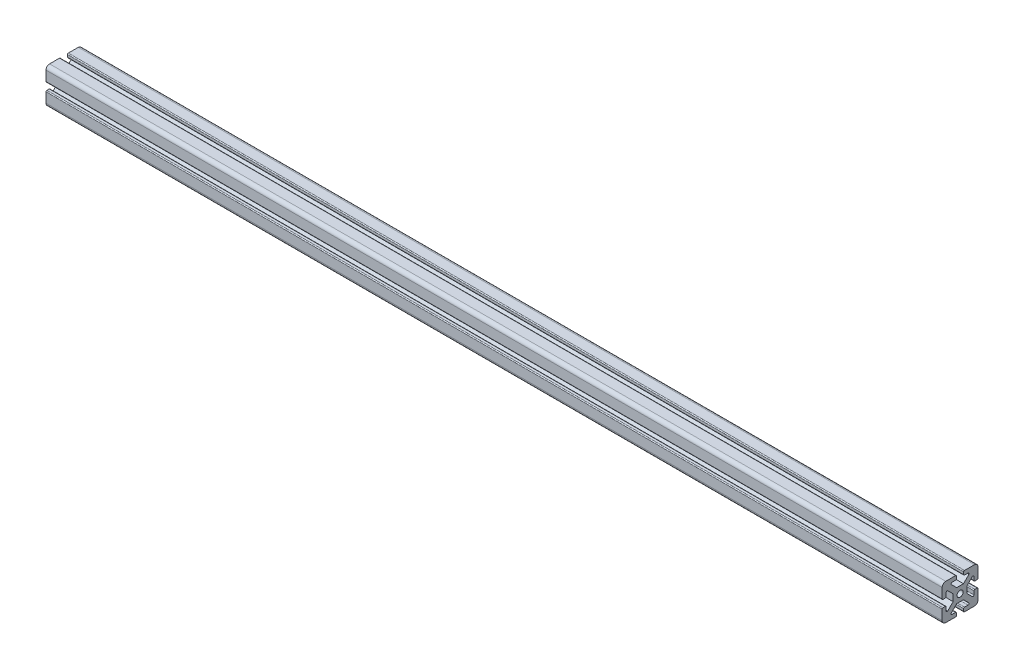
ISO-10303-21;
HEADER;
FILE_DESCRIPTION(('STEP AP214'),'2;1');
FILE_NAME('part.step','',(''),(''),'','','');
FILE_SCHEMA(('AUTOMOTIVE_DESIGN { 1 0 10303 214 1 1 1 1 }'));
ENDSEC;
DATA;
#1=APPLICATION_CONTEXT('core data for automotive mechanical design processes');
#2=APPLICATION_PROTOCOL_DEFINITION('international standard','automotive_design',2000,#1);
#3=PRODUCT_CONTEXT('',#1,'mechanical');
#4=PRODUCT('Part','Part','',(#3));
#5=PRODUCT_RELATED_PRODUCT_CATEGORY('part','',(#4));
#6=PRODUCT_DEFINITION_FORMATION('','',#4);
#7=PRODUCT_DEFINITION_CONTEXT('part definition',#1,'design');
#8=PRODUCT_DEFINITION('design','',#6,#7);
#9=PRODUCT_DEFINITION_SHAPE('','',#8);
#10=(LENGTH_UNIT() NAMED_UNIT(*) SI_UNIT(.MILLI.,.METRE.));
#11=(NAMED_UNIT(*) PLANE_ANGLE_UNIT() SI_UNIT($,.RADIAN.));
#12=(NAMED_UNIT(*) SI_UNIT($,.STERADIAN.) SOLID_ANGLE_UNIT());
#13=UNCERTAINTY_MEASURE_WITH_UNIT(LENGTH_MEASURE(1.E-05),#10,'distance_accuracy_value','');
#14=(GEOMETRIC_REPRESENTATION_CONTEXT(3) GLOBAL_UNCERTAINTY_ASSIGNED_CONTEXT((#13)) GLOBAL_UNIT_ASSIGNED_CONTEXT((#10,
#11,#12)) REPRESENTATION_CONTEXT('',''));
#15=CARTESIAN_POINT('',(0.,0.,0.));
#16=DIRECTION('',(0.,0.,1.));
#17=DIRECTION('',(1.,0.,0.));
#18=AXIS2_PLACEMENT_3D('',#15,#16,#17);
#19=CARTESIAN_POINT('',(1000.,16.,16.));
#20=DIRECTION('',(-1.,0.,0.));
#21=DIRECTION('',(0.,0.,1.));
#22=AXIS2_PLACEMENT_3D('',#19,#20,#21);
#23=CYLINDRICAL_SURFACE('',#22,4.);
#24=CARTESIAN_POINT('',(0.,16.,16.));
#25=DIRECTION('',(1.,0.,0.));
#26=DIRECTION('',(0.,0.,1.));
#27=AXIS2_PLACEMENT_3D('',#24,#25,#26);
#28=CIRCLE('',#27,4.);
#29=CARTESIAN_POINT('',(0.,20.,16.));
#30=VERTEX_POINT('',#29);
#31=CARTESIAN_POINT('',(0.,16.,20.));
#32=VERTEX_POINT('',#31);
#33=EDGE_CURVE('E712',#30,#32,#28,.T.);
#34=ORIENTED_EDGE('',*,*,#33,.T.);
#35=DIRECTION('',(-1.,0.,0.));
#36=VECTOR('',#35,1.);
#37=CARTESIAN_POINT('',(1000.,16.,20.));
#38=LINE('',#37,#36);
#39=CARTESIAN_POINT('',(1000.,16.,20.));
#40=VERTEX_POINT('',#39);
#41=EDGE_CURVE('E13',#40,#32,#38,.T.);
#42=ORIENTED_EDGE('',*,*,#41,.F.);
#43=CARTESIAN_POINT('',(1000.,16.,16.));
#44=DIRECTION('',(1.,0.,0.));
#45=DIRECTION('',(0.,0.,1.));
#46=AXIS2_PLACEMENT_3D('',#43,#44,#45);
#47=CIRCLE('',#46,4.);
#48=CARTESIAN_POINT('',(1000.,20.,16.));
#49=VERTEX_POINT('',#48);
#50=EDGE_CURVE('E1178',#49,#40,#47,.T.);
#51=ORIENTED_EDGE('',*,*,#50,.F.);
#52=DIRECTION('',(-1.,0.,0.));
#53=VECTOR('',#52,1.);
#54=CARTESIAN_POINT('',(1000.,20.,16.));
#55=LINE('',#54,#53);
#56=EDGE_CURVE('E705',#49,#30,#55,.T.);
#57=ORIENTED_EDGE('',*,*,#56,.T.);
#58=EDGE_LOOP('',(#34,#42,#51,#57));
#59=FACE_BOUND('',#58,.T.);
#60=ADVANCED_FACE('F276',(#59),#23,.T.);
#61=CARTESIAN_POINT('',(1000.,5.00000000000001,20.));
#62=DIRECTION('',(0.,0.,-1.));
#63=DIRECTION('',(-1.,0.,0.));
#64=AXIS2_PLACEMENT_3D('',#61,#62,#63);
#65=PLANE('',#64);
#66=DIRECTION('',(0.,-1.,0.));
#67=VECTOR('',#66,1.);
#68=CARTESIAN_POINT('',(0.,5.00000000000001,20.));
#69=LINE('',#68,#67);
#70=CARTESIAN_POINT('',(0.,5.00000000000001,20.));
#71=VERTEX_POINT('',#70);
#72=EDGE_CURVE('E715',#32,#71,#69,.T.);
#73=ORIENTED_EDGE('',*,*,#72,.T.);
#74=DIRECTION('',(-1.,0.,0.));
#75=VECTOR('',#74,1.);
#76=CARTESIAN_POINT('',(1000.,5.00000000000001,20.));
#77=LINE('',#76,#75);
#78=CARTESIAN_POINT('',(1000.,5.00000000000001,20.));
#79=VERTEX_POINT('',#78);
#80=EDGE_CURVE('E285',#79,#71,#77,.T.);
#81=ORIENTED_EDGE('',*,*,#80,.F.);
#82=DIRECTION('',(0.,-1.,0.));
#83=VECTOR('',#82,1.);
#84=CARTESIAN_POINT('',(1000.,5.00000000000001,20.));
#85=LINE('',#84,#83);
#86=EDGE_CURVE('E502',#40,#79,#85,.T.);
#87=ORIENTED_EDGE('',*,*,#86,.F.);
#88=ORIENTED_EDGE('',*,*,#41,.T.);
#89=EDGE_LOOP('',(#73,#81,#87,#88));
#90=FACE_BOUND('',#89,.T.);
#91=ADVANCED_FACE('F1197',(#90),#65,.F.);
#92=CARTESIAN_POINT('',(1000.,5.,19.));
#93=DIRECTION('',(-1.,0.,0.));
#94=DIRECTION('',(0.,0.,1.));
#95=AXIS2_PLACEMENT_3D('',#92,#93,#94);
#96=CYLINDRICAL_SURFACE('',#95,1.);
#97=CARTESIAN_POINT('',(0.,5.,19.));
#98=DIRECTION('',(1.,0.,0.));
#99=DIRECTION('',(0.,0.,1.));
#100=AXIS2_PLACEMENT_3D('',#97,#98,#99);
#101=CIRCLE('',#100,1.);
#102=CARTESIAN_POINT('',(0.,4.,19.));
#103=VERTEX_POINT('',#102);
#104=EDGE_CURVE('E717',#71,#103,#101,.T.);
#105=ORIENTED_EDGE('',*,*,#104,.T.);
#106=DIRECTION('',(-1.,0.,0.));
#107=VECTOR('',#106,1.);
#108=CARTESIAN_POINT('',(1000.,4.,19.));
#109=LINE('',#108,#107);
#110=CARTESIAN_POINT('',(1000.,4.,19.));
#111=VERTEX_POINT('',#110);
#112=EDGE_CURVE('E1027',#111,#103,#109,.T.);
#113=ORIENTED_EDGE('',*,*,#112,.F.);
#114=CARTESIAN_POINT('',(1000.,5.,19.));
#115=DIRECTION('',(1.,0.,0.));
#116=DIRECTION('',(0.,0.,1.));
#117=AXIS2_PLACEMENT_3D('',#114,#115,#116);
#118=CIRCLE('',#117,1.);
#119=EDGE_CURVE('E1035',#79,#111,#118,.T.);
#120=ORIENTED_EDGE('',*,*,#119,.F.);
#121=ORIENTED_EDGE('',*,*,#80,.T.);
#122=EDGE_LOOP('',(#105,#113,#120,#121));
#123=FACE_BOUND('',#122,.T.);
#124=ADVANCED_FACE('F1033',(#123),#96,.T.);
#125=CARTESIAN_POINT('',(1000.,4.,16.5));
#126=DIRECTION('',(0.,1.,0.));
#127=DIRECTION('',(0.,0.,1.));
#128=AXIS2_PLACEMENT_3D('',#125,#126,#127);
#129=PLANE('',#128);
#130=DIRECTION('',(0.,0.,-1.));
#131=VECTOR('',#130,1.);
#132=CARTESIAN_POINT('',(0.,4.,16.5));
#133=LINE('',#132,#131);
#134=CARTESIAN_POINT('',(0.,4.,16.5));
#135=VERTEX_POINT('',#134);
#136=EDGE_CURVE('E720',#103,#135,#133,.T.);
#137=ORIENTED_EDGE('',*,*,#136,.T.);
#138=DIRECTION('',(-1.,0.,0.));
#139=VECTOR('',#138,1.);
#140=CARTESIAN_POINT('',(1000.,4.,16.5));
#141=LINE('',#140,#139);
#142=CARTESIAN_POINT('',(1000.,4.,16.5));
#143=VERTEX_POINT('',#142);
#144=EDGE_CURVE('E1024',#143,#135,#141,.T.);
#145=ORIENTED_EDGE('',*,*,#144,.F.);
#146=DIRECTION('',(0.,0.,-1.));
#147=VECTOR('',#146,1.);
#148=CARTESIAN_POINT('',(1000.,4.,19.));
#149=LINE('',#148,#147);
#150=EDGE_CURVE('E1050',#111,#143,#149,.T.);
#151=ORIENTED_EDGE('',*,*,#150,.F.);
#152=ORIENTED_EDGE('',*,*,#112,.T.);
#153=EDGE_LOOP('',(#137,#145,#151,#152));
#154=FACE_BOUND('',#153,.T.);
#155=ADVANCED_FACE('F1041',(#154),#129,.F.);
#156=CARTESIAN_POINT('',(1000.,5.,16.5));
#157=DIRECTION('',(-1.,0.,0.));
#158=DIRECTION('',(0.,0.,1.));
#159=AXIS2_PLACEMENT_3D('',#156,#157,#158);
#160=CYLINDRICAL_SURFACE('',#159,1.);
#161=CARTESIAN_POINT('',(0.,5.,16.5));
#162=DIRECTION('',(1.,0.,0.));
#163=DIRECTION('',(0.,0.,-1.));
#164=AXIS2_PLACEMENT_3D('',#161,#162,#163);
#165=CIRCLE('',#164,1.);
#166=CARTESIAN_POINT('',(0.,5.,15.5));
#167=VERTEX_POINT('',#166);
#168=EDGE_CURVE('E722',#135,#167,#165,.T.);
#169=ORIENTED_EDGE('',*,*,#168,.T.);
#170=DIRECTION('',(-1.,0.,0.));
#171=VECTOR('',#170,1.);
#172=CARTESIAN_POINT('',(1000.,5.,15.5));
#173=LINE('',#172,#171);
#174=CARTESIAN_POINT('',(1000.,5.,15.5));
#175=VERTEX_POINT('',#174);
#176=EDGE_CURVE('E1021',#175,#167,#173,.T.);
#177=ORIENTED_EDGE('',*,*,#176,.F.);
#178=CARTESIAN_POINT('',(1000.,5.,16.5));
#179=DIRECTION('',(1.,0.,0.));
#180=DIRECTION('',(0.,0.,-1.));
#181=AXIS2_PLACEMENT_3D('',#178,#179,#180);
#182=CIRCLE('',#181,1.);
#183=EDGE_CURVE('E1047',#143,#175,#182,.T.);
#184=ORIENTED_EDGE('',*,*,#183,.F.);
#185=ORIENTED_EDGE('',*,*,#144,.T.);
#186=EDGE_LOOP('',(#169,#177,#184,#185));
#187=FACE_BOUND('',#186,.T.);
#188=ADVANCED_FACE('F1045',(#187),#160,.T.);
#189=CARTESIAN_POINT('',(1000.,8.91611505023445,15.5));
#190=DIRECTION('',(0.,0.,1.));
#191=DIRECTION('',(0.,-1.,0.));
#192=AXIS2_PLACEMENT_3D('',#189,#190,#191);
#193=PLANE('',#192);
#194=DIRECTION('',(0.,1.,0.));
#195=VECTOR('',#194,1.);
#196=CARTESIAN_POINT('',(0.,8.91611505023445,15.5));
#197=LINE('',#196,#195);
#198=CARTESIAN_POINT('',(0.,8.91611505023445,15.5));
#199=VERTEX_POINT('',#198);
#200=EDGE_CURVE('E724',#167,#199,#197,.T.);
#201=ORIENTED_EDGE('',*,*,#200,.T.);
#202=DIRECTION('',(-1.,0.,0.));
#203=VECTOR('',#202,1.);
#204=CARTESIAN_POINT('',(1000.,8.91611505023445,15.5));
#205=LINE('',#204,#203);
#206=CARTESIAN_POINT('',(1000.,8.91611505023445,15.5));
#207=VERTEX_POINT('',#206);
#208=EDGE_CURVE('E1018',#207,#199,#205,.T.);
#209=ORIENTED_EDGE('',*,*,#208,.F.);
#210=DIRECTION('',(0.,1.,0.));
#211=VECTOR('',#210,1.);
#212=CARTESIAN_POINT('',(1000.,8.91611505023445,15.5));
#213=LINE('',#212,#211);
#214=EDGE_CURVE('E1049',#175,#207,#213,.T.);
#215=ORIENTED_EDGE('',*,*,#214,.F.);
#216=ORIENTED_EDGE('',*,*,#176,.T.);
#217=EDGE_LOOP('',(#201,#209,#215,#216));
#218=FACE_BOUND('',#217,.T.);
#219=ADVANCED_FACE('F1209',(#218),#193,.F.);
#220=CARTESIAN_POINT('',(1000.,8.91611505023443,14.4161150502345));
#221=DIRECTION('',(-1.,0.,0.));
#222=DIRECTION('',(0.,0.,1.));
#223=AXIS2_PLACEMENT_3D('',#220,#221,#222);
#224=CYLINDRICAL_SURFACE('',#223,1.08388494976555);
#225=CARTESIAN_POINT('',(0.,8.91611505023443,14.4161150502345));
#226=DIRECTION('',(-1.,0.,0.));
#227=DIRECTION('',(0.,0.,-1.));
#228=AXIS2_PLACEMENT_3D('',#225,#226,#227);
#229=CIRCLE('',#228,1.08388494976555);
#230=CARTESIAN_POINT('',(0.,9.7888075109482,13.773297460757));
#231=VERTEX_POINT('',#230);
#232=EDGE_CURVE('E726',#199,#231,#229,.T.);
#233=ORIENTED_EDGE('',*,*,#232,.T.);
#234=DIRECTION('',(-1.,0.,0.));
#235=VECTOR('',#234,1.);
#236=CARTESIAN_POINT('',(1000.,9.7888075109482,13.773297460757));
#237=LINE('',#236,#235);
#238=CARTESIAN_POINT('',(1000.,9.7888075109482,13.773297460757));
#239=VERTEX_POINT('',#238);
#240=EDGE_CURVE('E1015',#239,#231,#237,.T.);
#241=ORIENTED_EDGE('',*,*,#240,.F.);
#242=CARTESIAN_POINT('',(1000.,8.91611505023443,14.4161150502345));
#243=DIRECTION('',(-1.,0.,0.));
#244=DIRECTION('',(0.,0.,-1.));
#245=AXIS2_PLACEMENT_3D('',#242,#243,#244);
#246=CIRCLE('',#245,1.08388494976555);
#247=EDGE_CURVE('E1052',#207,#239,#246,.T.);
#248=ORIENTED_EDGE('',*,*,#247,.F.);
#249=ORIENTED_EDGE('',*,*,#208,.T.);
#250=EDGE_LOOP('',(#233,#241,#248,#249));
#251=FACE_BOUND('',#250,.T.);
#252=ADVANCED_FACE('F1212',(#251),#224,.F.);
#253=CARTESIAN_POINT('',(1000.,9.7888075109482,13.773297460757));
#254=DIRECTION('',(0.,0.708751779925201,-0.705457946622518));
#255=DIRECTION('',(0.,0.705457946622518,0.708751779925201));
#256=AXIS2_PLACEMENT_3D('',#253,#254,#255);
#257=PLANE('',#256);
#258=DIRECTION('',(0.,-0.705457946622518,-0.708751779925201));
#259=VECTOR('',#258,1.);
#260=CARTESIAN_POINT('',(0.,9.7888075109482,13.773297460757));
#261=LINE('',#260,#259);
#262=CARTESIAN_POINT('',(0.,3.79350255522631,7.75000000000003));
#263=VERTEX_POINT('',#262);
#264=EDGE_CURVE('E728',#231,#263,#261,.T.);
#265=ORIENTED_EDGE('',*,*,#264,.T.);
#266=DIRECTION('',(-1.,0.,0.));
#267=VECTOR('',#266,1.);
#268=CARTESIAN_POINT('',(1000.,3.79350255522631,7.75000000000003));
#269=LINE('',#268,#267);
#270=CARTESIAN_POINT('',(1000.,3.79350255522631,7.75000000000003));
#271=VERTEX_POINT('',#270);
#272=EDGE_CURVE('E1012',#271,#263,#269,.T.);
#273=ORIENTED_EDGE('',*,*,#272,.F.);
#274=DIRECTION('',(0.,-0.705457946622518,-0.708751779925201));
#275=VECTOR('',#274,1.);
#276=CARTESIAN_POINT('',(1000.,9.7888075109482,13.773297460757));
#277=LINE('',#276,#275);
#278=EDGE_CURVE('E1058',#239,#271,#277,.T.);
#279=ORIENTED_EDGE('',*,*,#278,.F.);
#280=ORIENTED_EDGE('',*,*,#240,.T.);
#281=EDGE_LOOP('',(#265,#273,#279,#280));
#282=FACE_BOUND('',#281,.T.);
#283=ADVANCED_FACE('F1216',(#282),#257,.F.);
#284=CARTESIAN_POINT('',(1000.,3.79350255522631,7.75000000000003));
#285=DIRECTION('',(0.,0.,-1.));
#286=DIRECTION('',(-1.,0.,0.));
#287=AXIS2_PLACEMENT_3D('',#284,#285,#286);
#288=PLANE('',#287);
#289=DIRECTION('',(0.,-1.,0.));
#290=VECTOR('',#289,1.);
#291=CARTESIAN_POINT('',(0.,3.79350255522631,7.75000000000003));
#292=LINE('',#291,#290);
#293=CARTESIAN_POINT('',(0.,-3.79350255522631,7.75000000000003));
#294=VERTEX_POINT('',#293);
#295=EDGE_CURVE('E730',#263,#294,#292,.T.);
#296=ORIENTED_EDGE('',*,*,#295,.T.);
#297=DIRECTION('',(-1.,0.,0.));
#298=VECTOR('',#297,1.);
#299=CARTESIAN_POINT('',(1000.,-3.79350255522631,7.75000000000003));
#300=LINE('',#299,#298);
#301=CARTESIAN_POINT('',(1000.,-3.79350255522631,7.75000000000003));
#302=VERTEX_POINT('',#301);
#303=EDGE_CURVE('E1009',#302,#294,#300,.T.);
#304=ORIENTED_EDGE('',*,*,#303,.F.);
#305=DIRECTION('',(0.,-1.,0.));
#306=VECTOR('',#305,1.);
#307=CARTESIAN_POINT('',(1000.,3.79350255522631,7.75000000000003));
#308=LINE('',#307,#306);
#309=EDGE_CURVE('E1060',#271,#302,#308,.T.);
#310=ORIENTED_EDGE('',*,*,#309,.F.);
#311=ORIENTED_EDGE('',*,*,#272,.T.);
#312=EDGE_LOOP('',(#296,#304,#310,#311));
#313=FACE_BOUND('',#312,.T.);
#314=ADVANCED_FACE('F1220',(#313),#288,.F.);
#315=CARTESIAN_POINT('',(1000.,-9.78880751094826,13.773297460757));
#316=DIRECTION('',(0.,-0.708751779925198,-0.705457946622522));
#317=DIRECTION('',(0.,0.705457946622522,-0.708751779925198));
#318=AXIS2_PLACEMENT_3D('',#315,#316,#317);
#319=PLANE('',#318);
#320=DIRECTION('',(0.,-0.705457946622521,0.708751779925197));
#321=VECTOR('',#320,1.);
#322=CARTESIAN_POINT('',(0.,-9.78880751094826,13.773297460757));
#323=LINE('',#322,#321);
#324=CARTESIAN_POINT('',(0.,-9.78880751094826,13.773297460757));
#325=VERTEX_POINT('',#324);
#326=EDGE_CURVE('E732',#294,#325,#323,.T.);
#327=ORIENTED_EDGE('',*,*,#326,.T.);
#328=DIRECTION('',(-1.,0.,0.));
#329=VECTOR('',#328,1.);
#330=CARTESIAN_POINT('',(1000.,-9.78880751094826,13.773297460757));
#331=LINE('',#330,#329);
#332=CARTESIAN_POINT('',(1000.,-9.78880751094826,13.773297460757));
#333=VERTEX_POINT('',#332);
#334=EDGE_CURVE('E1006',#333,#325,#331,.T.);
#335=ORIENTED_EDGE('',*,*,#334,.F.);
#336=DIRECTION('',(0.,-0.705457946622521,0.708751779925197));
#337=VECTOR('',#336,1.);
#338=CARTESIAN_POINT('',(1000.,-9.78880751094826,13.773297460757));
#339=LINE('',#338,#337);
#340=EDGE_CURVE('E1062',#302,#333,#339,.T.);
#341=ORIENTED_EDGE('',*,*,#340,.F.);
#342=ORIENTED_EDGE('',*,*,#303,.T.);
#343=EDGE_LOOP('',(#327,#335,#341,#342));
#344=FACE_BOUND('',#343,.T.);
#345=ADVANCED_FACE('F1224',(#344),#319,.F.);
#346=CARTESIAN_POINT('',(1000.,-8.91611505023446,14.4161150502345));
#347=DIRECTION('',(-1.,0.,0.));
#348=DIRECTION('',(0.,0.,1.));
#349=AXIS2_PLACEMENT_3D('',#346,#347,#348);
#350=CYLINDRICAL_SURFACE('',#349,1.08388494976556);
#351=CARTESIAN_POINT('',(0.,-8.91611505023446,14.4161150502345));
#352=DIRECTION('',(-1.,0.,0.));
#353=DIRECTION('',(0.,0.,-1.));
#354=AXIS2_PLACEMENT_3D('',#351,#352,#353);
#355=CIRCLE('',#354,1.08388494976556);
#356=CARTESIAN_POINT('',(0.,-8.91611505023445,15.5));
#357=VERTEX_POINT('',#356);
#358=EDGE_CURVE('E734',#325,#357,#355,.T.);
#359=ORIENTED_EDGE('',*,*,#358,.T.);
#360=DIRECTION('',(-1.,0.,0.));
#361=VECTOR('',#360,1.);
#362=CARTESIAN_POINT('',(1000.,-8.91611505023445,15.5));
#363=LINE('',#362,#361);
#364=CARTESIAN_POINT('',(1000.,-8.91611505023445,15.5));
#365=VERTEX_POINT('',#364);
#366=EDGE_CURVE('E1003',#365,#357,#363,.T.);
#367=ORIENTED_EDGE('',*,*,#366,.F.);
#368=CARTESIAN_POINT('',(1000.,-8.91611505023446,14.4161150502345));
#369=DIRECTION('',(-1.,0.,0.));
#370=DIRECTION('',(0.,0.,-1.));
#371=AXIS2_PLACEMENT_3D('',#368,#369,#370);
#372=CIRCLE('',#371,1.08388494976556);
#373=EDGE_CURVE('E1064',#333,#365,#372,.T.);
#374=ORIENTED_EDGE('',*,*,#373,.F.);
#375=ORIENTED_EDGE('',*,*,#334,.T.);
#376=EDGE_LOOP('',(#359,#367,#374,#375));
#377=FACE_BOUND('',#376,.T.);
#378=ADVANCED_FACE('F1228',(#377),#350,.F.);
#379=CARTESIAN_POINT('',(1000.,-5.,15.5));
#380=DIRECTION('',(0.,0.,1.));
#381=DIRECTION('',(0.,-1.,0.));
#382=AXIS2_PLACEMENT_3D('',#379,#380,#381);
#383=PLANE('',#382);
#384=DIRECTION('',(0.,1.,0.));
#385=VECTOR('',#384,1.);
#386=CARTESIAN_POINT('',(0.,-5.,15.5));
#387=LINE('',#386,#385);
#388=CARTESIAN_POINT('',(0.,-5.,15.5));
#389=VERTEX_POINT('',#388);
#390=EDGE_CURVE('E736',#357,#389,#387,.T.);
#391=ORIENTED_EDGE('',*,*,#390,.T.);
#392=DIRECTION('',(-1.,0.,0.));
#393=VECTOR('',#392,1.);
#394=CARTESIAN_POINT('',(1000.,-5.,15.5));
#395=LINE('',#394,#393);
#396=CARTESIAN_POINT('',(1000.,-5.,15.5));
#397=VERTEX_POINT('',#396);
#398=EDGE_CURVE('E1000',#397,#389,#395,.T.);
#399=ORIENTED_EDGE('',*,*,#398,.F.);
#400=DIRECTION('',(0.,1.,0.));
#401=VECTOR('',#400,1.);
#402=CARTESIAN_POINT('',(1000.,-5.,15.5));
#403=LINE('',#402,#401);
#404=EDGE_CURVE('E1066',#365,#397,#403,.T.);
#405=ORIENTED_EDGE('',*,*,#404,.F.);
#406=ORIENTED_EDGE('',*,*,#366,.T.);
#407=EDGE_LOOP('',(#391,#399,#405,#406));
#408=FACE_BOUND('',#407,.T.);
#409=ADVANCED_FACE('F1232',(#408),#383,.F.);
#410=CARTESIAN_POINT('',(1000.,-5.00000000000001,16.5));
#411=DIRECTION('',(-1.,0.,0.));
#412=DIRECTION('',(0.,0.,1.));
#413=AXIS2_PLACEMENT_3D('',#410,#411,#412);
#414=CYLINDRICAL_SURFACE('',#413,0.999999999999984);
#415=CARTESIAN_POINT('',(0.,-5.00000000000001,16.5));
#416=DIRECTION('',(1.,0.,0.));
#417=DIRECTION('',(0.,0.,-1.));
#418=AXIS2_PLACEMENT_3D('',#415,#416,#417);
#419=CIRCLE('',#418,0.999999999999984);
#420=CARTESIAN_POINT('',(0.,-4.00000000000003,16.5));
#421=VERTEX_POINT('',#420);
#422=EDGE_CURVE('E738',#389,#421,#419,.T.);
#423=ORIENTED_EDGE('',*,*,#422,.T.);
#424=DIRECTION('',(-1.,0.,0.));
#425=VECTOR('',#424,1.);
#426=CARTESIAN_POINT('',(1000.,-4.00000000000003,16.5));
#427=LINE('',#426,#425);
#428=CARTESIAN_POINT('',(1000.,-4.00000000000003,16.5));
#429=VERTEX_POINT('',#428);
#430=EDGE_CURVE('E997',#429,#421,#427,.T.);
#431=ORIENTED_EDGE('',*,*,#430,.F.);
#432=CARTESIAN_POINT('',(1000.,-5.00000000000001,16.5));
#433=DIRECTION('',(1.,0.,0.));
#434=DIRECTION('',(0.,0.,-1.));
#435=AXIS2_PLACEMENT_3D('',#432,#433,#434);
#436=CIRCLE('',#435,0.999999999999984);
#437=EDGE_CURVE('E1068',#397,#429,#436,.T.);
#438=ORIENTED_EDGE('',*,*,#437,.F.);
#439=ORIENTED_EDGE('',*,*,#398,.T.);
#440=EDGE_LOOP('',(#423,#431,#438,#439));
#441=FACE_BOUND('',#440,.T.);
#442=ADVANCED_FACE('F1236',(#441),#414,.T.);
#443=CARTESIAN_POINT('',(1000.,-4.,18.5));
#444=DIRECTION('',(0.,-1.,0.));
#445=DIRECTION('',(0.,0.,-1.));
#446=AXIS2_PLACEMENT_3D('',#443,#444,#445);
#447=PLANE('',#446);
#448=DIRECTION('',(0.,0.,1.));
#449=VECTOR('',#448,1.);
#450=CARTESIAN_POINT('',(0.,-4.,18.5));
#451=LINE('',#450,#449);
#452=CARTESIAN_POINT('',(0.,-4.,19.));
#453=VERTEX_POINT('',#452);
#454=EDGE_CURVE('E741',#421,#453,#451,.T.);
#455=ORIENTED_EDGE('',*,*,#454,.T.);
#456=DIRECTION('',(-1.,0.,0.));
#457=VECTOR('',#456,1.);
#458=CARTESIAN_POINT('',(1000.,-4.,19.));
#459=LINE('',#458,#457);
#460=CARTESIAN_POINT('',(1000.,-4.,19.));
#461=VERTEX_POINT('',#460);
#462=EDGE_CURVE('E994',#461,#453,#459,.T.);
#463=ORIENTED_EDGE('',*,*,#462,.F.);
#464=DIRECTION('',(0.,0.,1.));
#465=VECTOR('',#464,1.);
#466=CARTESIAN_POINT('',(1000.,-4.,18.5));
#467=LINE('',#466,#465);
#468=EDGE_CURVE('E1070',#429,#461,#467,.T.);
#469=ORIENTED_EDGE('',*,*,#468,.F.);
#470=ORIENTED_EDGE('',*,*,#430,.T.);
#471=EDGE_LOOP('',(#455,#463,#469,#470));
#472=FACE_BOUND('',#471,.T.);
#473=ADVANCED_FACE('F1240',(#472),#447,.F.);
#474=CARTESIAN_POINT('',(1000.,-5.,19.));
#475=DIRECTION('',(-1.,0.,0.));
#476=DIRECTION('',(0.,0.,1.));
#477=AXIS2_PLACEMENT_3D('',#474,#475,#476);
#478=CYLINDRICAL_SURFACE('',#477,0.999999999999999);
#479=CARTESIAN_POINT('',(0.,-5.,19.));
#480=DIRECTION('',(1.,0.,0.));
#481=DIRECTION('',(0.,0.,-1.));
#482=AXIS2_PLACEMENT_3D('',#479,#480,#481);
#483=CIRCLE('',#482,0.999999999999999);
#484=CARTESIAN_POINT('',(0.,-5.,20.));
#485=VERTEX_POINT('',#484);
#486=EDGE_CURVE('E743',#453,#485,#483,.T.);
#487=ORIENTED_EDGE('',*,*,#486,.T.);
#488=DIRECTION('',(-1.,0.,0.));
#489=VECTOR('',#488,1.);
#490=CARTESIAN_POINT('',(1000.,-5.,20.));
#491=LINE('',#490,#489);
#492=CARTESIAN_POINT('',(1000.,-5.,20.));
#493=VERTEX_POINT('',#492);
#494=EDGE_CURVE('E991',#493,#485,#491,.T.);
#495=ORIENTED_EDGE('',*,*,#494,.F.);
#496=CARTESIAN_POINT('',(1000.,-5.,19.));
#497=DIRECTION('',(1.,0.,0.));
#498=DIRECTION('',(0.,0.,-1.));
#499=AXIS2_PLACEMENT_3D('',#496,#497,#498);
#500=CIRCLE('',#499,0.999999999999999);
#501=EDGE_CURVE('E1072',#461,#493,#500,.T.);
#502=ORIENTED_EDGE('',*,*,#501,.F.);
#503=ORIENTED_EDGE('',*,*,#462,.T.);
#504=EDGE_LOOP('',(#487,#495,#502,#503));
#505=FACE_BOUND('',#504,.T.);
#506=ADVANCED_FACE('F1244',(#505),#478,.T.);
#507=CARTESIAN_POINT('',(1000.,-16.,20.));
#508=DIRECTION('',(0.,0.,-1.));
#509=DIRECTION('',(0.,1.,0.));
#510=AXIS2_PLACEMENT_3D('',#507,#508,#509);
#511=PLANE('',#510);
#512=DIRECTION('',(0.,-1.,0.));
#513=VECTOR('',#512,1.);
#514=CARTESIAN_POINT('',(0.,-16.,20.));
#515=LINE('',#514,#513);
#516=CARTESIAN_POINT('',(0.,-16.,20.));
#517=VERTEX_POINT('',#516);
#518=EDGE_CURVE('E745',#485,#517,#515,.T.);
#519=ORIENTED_EDGE('',*,*,#518,.T.);
#520=DIRECTION('',(-1.,0.,0.));
#521=VECTOR('',#520,1.);
#522=CARTESIAN_POINT('',(1000.,-16.,20.));
#523=LINE('',#522,#521);
#524=CARTESIAN_POINT('',(1000.,-16.,20.));
#525=VERTEX_POINT('',#524);
#526=EDGE_CURVE('E988',#525,#517,#523,.T.);
#527=ORIENTED_EDGE('',*,*,#526,.F.);
#528=DIRECTION('',(0.,-1.,0.));
#529=VECTOR('',#528,1.);
#530=CARTESIAN_POINT('',(1000.,-16.,20.));
#531=LINE('',#530,#529);
#532=EDGE_CURVE('E1074',#493,#525,#531,.T.);
#533=ORIENTED_EDGE('',*,*,#532,.F.);
#534=ORIENTED_EDGE('',*,*,#494,.T.);
#535=EDGE_LOOP('',(#519,#527,#533,#534));
#536=FACE_BOUND('',#535,.T.);
#537=ADVANCED_FACE('F1248',(#536),#511,.F.);
#538=CARTESIAN_POINT('',(1000.,-16.,16.));
#539=DIRECTION('',(-1.,0.,0.));
#540=DIRECTION('',(0.,0.,1.));
#541=AXIS2_PLACEMENT_3D('',#538,#539,#540);
#542=CYLINDRICAL_SURFACE('',#541,3.99999999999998);
#543=CARTESIAN_POINT('',(0.,-16.,16.));
#544=DIRECTION('',(1.,0.,0.));
#545=DIRECTION('',(0.,0.,-1.));
#546=AXIS2_PLACEMENT_3D('',#543,#544,#545);
#547=CIRCLE('',#546,3.99999999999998);
#548=CARTESIAN_POINT('',(0.,-20.,16.));
#549=VERTEX_POINT('',#548);
#550=EDGE_CURVE('E747',#517,#549,#547,.T.);
#551=ORIENTED_EDGE('',*,*,#550,.T.);
#552=DIRECTION('',(-1.,0.,0.));
#553=VECTOR('',#552,1.);
#554=CARTESIAN_POINT('',(1000.,-20.,16.));
#555=LINE('',#554,#553);
#556=CARTESIAN_POINT('',(1000.,-20.,16.));
#557=VERTEX_POINT('',#556);
#558=EDGE_CURVE('E985',#557,#549,#555,.T.);
#559=ORIENTED_EDGE('',*,*,#558,.F.);
#560=CARTESIAN_POINT('',(1000.,-16.,16.));
#561=DIRECTION('',(1.,0.,0.));
#562=DIRECTION('',(0.,0.,-1.));
#563=AXIS2_PLACEMENT_3D('',#560,#561,#562);
#564=CIRCLE('',#563,3.99999999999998);
#565=EDGE_CURVE('E1076',#525,#557,#564,.T.);
#566=ORIENTED_EDGE('',*,*,#565,.F.);
#567=ORIENTED_EDGE('',*,*,#526,.T.);
#568=EDGE_LOOP('',(#551,#559,#566,#567));
#569=FACE_BOUND('',#568,.T.);
#570=ADVANCED_FACE('F1252',(#569),#542,.T.);
#571=CARTESIAN_POINT('',(1000.,-20.,5.50000000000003));
#572=DIRECTION('',(0.,1.,0.));
#573=DIRECTION('',(0.,0.,1.));
#574=AXIS2_PLACEMENT_3D('',#571,#572,#573);
#575=PLANE('',#574);
#576=DIRECTION('',(0.,0.,-1.));
#577=VECTOR('',#576,1.);
#578=CARTESIAN_POINT('',(0.,-20.,5.50000000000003));
#579=LINE('',#578,#577);
#580=CARTESIAN_POINT('',(0.,-20.,5.00000000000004));
#581=VERTEX_POINT('',#580);
#582=EDGE_CURVE('E750',#549,#581,#579,.T.);
#583=ORIENTED_EDGE('',*,*,#582,.T.);
#584=DIRECTION('',(-1.,0.,0.));
#585=VECTOR('',#584,1.);
#586=CARTESIAN_POINT('',(1000.,-20.,5.00000000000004));
#587=LINE('',#586,#585);
#588=CARTESIAN_POINT('',(1000.,-20.,5.00000000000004));
#589=VERTEX_POINT('',#588);
#590=EDGE_CURVE('E982',#589,#581,#587,.T.);
#591=ORIENTED_EDGE('',*,*,#590,.F.);
#592=DIRECTION('',(0.,0.,-1.));
#593=VECTOR('',#592,1.);
#594=CARTESIAN_POINT('',(1000.,-20.,5.50000000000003));
#595=LINE('',#594,#593);
#596=EDGE_CURVE('E1078',#557,#589,#595,.T.);
#597=ORIENTED_EDGE('',*,*,#596,.F.);
#598=ORIENTED_EDGE('',*,*,#558,.T.);
#599=EDGE_LOOP('',(#583,#591,#597,#598));
#600=FACE_BOUND('',#599,.T.);
#601=ADVANCED_FACE('F1256',(#600),#575,.F.);
#602=CARTESIAN_POINT('',(1000.,-19.,5.00000000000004));
#603=DIRECTION('',(-1.,0.,0.));
#604=DIRECTION('',(0.,0.,1.));
#605=AXIS2_PLACEMENT_3D('',#602,#603,#604);
#606=CYLINDRICAL_SURFACE('',#605,1.);
#607=CARTESIAN_POINT('',(0.,-19.,5.00000000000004));
#608=DIRECTION('',(1.,0.,0.));
#609=DIRECTION('',(0.,0.,-1.));
#610=AXIS2_PLACEMENT_3D('',#607,#608,#609);
#611=CIRCLE('',#610,1.);
#612=CARTESIAN_POINT('',(0.,-19.,4.00000000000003));
#613=VERTEX_POINT('',#612);
#614=EDGE_CURVE('E752',#581,#613,#611,.T.);
#615=ORIENTED_EDGE('',*,*,#614,.T.);
#616=DIRECTION('',(-1.,0.,0.));
#617=VECTOR('',#616,1.);
#618=CARTESIAN_POINT('',(1000.,-19.,4.00000000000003));
#619=LINE('',#618,#617);
#620=CARTESIAN_POINT('',(1000.,-19.,4.00000000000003));
#621=VERTEX_POINT('',#620);
#622=EDGE_CURVE('E979',#621,#613,#619,.T.);
#623=ORIENTED_EDGE('',*,*,#622,.F.);
#624=CARTESIAN_POINT('',(1000.,-19.,5.00000000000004));
#625=DIRECTION('',(1.,0.,0.));
#626=DIRECTION('',(0.,0.,-1.));
#627=AXIS2_PLACEMENT_3D('',#624,#625,#626);
#628=CIRCLE('',#627,1.);
#629=EDGE_CURVE('E1080',#589,#621,#628,.T.);
#630=ORIENTED_EDGE('',*,*,#629,.F.);
#631=ORIENTED_EDGE('',*,*,#590,.T.);
#632=EDGE_LOOP('',(#615,#623,#630,#631));
#633=FACE_BOUND('',#632,.T.);
#634=ADVANCED_FACE('F1260',(#633),#606,.T.);
#635=CARTESIAN_POINT('',(1000.,-16.5,4.00000000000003));
#636=DIRECTION('',(0.,0.,1.));
#637=DIRECTION('',(0.,-1.,0.));
#638=AXIS2_PLACEMENT_3D('',#635,#636,#637);
#639=PLANE('',#638);
#640=DIRECTION('',(0.,1.,0.));
#641=VECTOR('',#640,1.);
#642=CARTESIAN_POINT('',(0.,-16.5,4.00000000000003));
#643=LINE('',#642,#641);
#644=CARTESIAN_POINT('',(0.,-16.5,4.00000000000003));
#645=VERTEX_POINT('',#644);
#646=EDGE_CURVE('E755',#613,#645,#643,.T.);
#647=ORIENTED_EDGE('',*,*,#646,.T.);
#648=DIRECTION('',(-1.,0.,0.));
#649=VECTOR('',#648,1.);
#650=CARTESIAN_POINT('',(1000.,-16.5,4.00000000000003));
#651=LINE('',#650,#649);
#652=CARTESIAN_POINT('',(1000.,-16.5,4.00000000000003));
#653=VERTEX_POINT('',#652);
#654=EDGE_CURVE('E976',#653,#645,#651,.T.);
#655=ORIENTED_EDGE('',*,*,#654,.F.);
#656=DIRECTION('',(0.,1.,0.));
#657=VECTOR('',#656,1.);
#658=CARTESIAN_POINT('',(1000.,-19.,4.00000000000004));
#659=LINE('',#658,#657);
#660=EDGE_CURVE('E1082',#621,#653,#659,.T.);
#661=ORIENTED_EDGE('',*,*,#660,.F.);
#662=ORIENTED_EDGE('',*,*,#622,.T.);
#663=EDGE_LOOP('',(#647,#655,#661,#662));
#664=FACE_BOUND('',#663,.T.);
#665=ADVANCED_FACE('F1264',(#664),#639,.F.);
#666=CARTESIAN_POINT('',(1000.,-16.5,5.00000000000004));
#667=DIRECTION('',(-1.,0.,0.));
#668=DIRECTION('',(0.,0.,1.));
#669=AXIS2_PLACEMENT_3D('',#666,#667,#668);
#670=CYLINDRICAL_SURFACE('',#669,1.);
#671=CARTESIAN_POINT('',(0.,-16.5,5.00000000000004));
#672=DIRECTION('',(1.,0.,0.));
#673=DIRECTION('',(0.,0.,-1.));
#674=AXIS2_PLACEMENT_3D('',#671,#672,#673);
#675=CIRCLE('',#674,1.);
#676=CARTESIAN_POINT('',(0.,-15.5,5.00000000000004));
#677=VERTEX_POINT('',#676);
#678=EDGE_CURVE('E757',#645,#677,#675,.T.);
#679=ORIENTED_EDGE('',*,*,#678,.T.);
#680=DIRECTION('',(-1.,0.,0.));
#681=VECTOR('',#680,1.);
#682=CARTESIAN_POINT('',(1000.,-15.5,5.00000000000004));
#683=LINE('',#682,#681);
#684=CARTESIAN_POINT('',(1000.,-15.5,5.00000000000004));
#685=VERTEX_POINT('',#684);
#686=EDGE_CURVE('E973',#685,#677,#683,.T.);
#687=ORIENTED_EDGE('',*,*,#686,.F.);
#688=CARTESIAN_POINT('',(1000.,-16.5,5.00000000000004));
#689=DIRECTION('',(1.,0.,0.));
#690=DIRECTION('',(0.,0.,-1.));
#691=AXIS2_PLACEMENT_3D('',#688,#689,#690);
#692=CIRCLE('',#691,1.);
#693=EDGE_CURVE('E1084',#653,#685,#692,.T.);
#694=ORIENTED_EDGE('',*,*,#693,.F.);
#695=ORIENTED_EDGE('',*,*,#654,.T.);
#696=EDGE_LOOP('',(#679,#687,#694,#695));
#697=FACE_BOUND('',#696,.T.);
#698=ADVANCED_FACE('F1268',(#697),#670,.T.);
#699=CARTESIAN_POINT('',(1000.,-15.5,8.91611505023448));
#700=DIRECTION('',(0.,-1.,0.));
#701=DIRECTION('',(0.,0.,-1.));
#702=AXIS2_PLACEMENT_3D('',#699,#700,#701);
#703=PLANE('',#702);
#704=DIRECTION('',(0.,0.,1.));
#705=VECTOR('',#704,1.);
#706=CARTESIAN_POINT('',(0.,-15.5,8.91611505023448));
#707=LINE('',#706,#705);
#708=CARTESIAN_POINT('',(0.,-15.5,8.91611505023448));
#709=VERTEX_POINT('',#708);
#710=EDGE_CURVE('E759',#677,#709,#707,.T.);
#711=ORIENTED_EDGE('',*,*,#710,.T.);
#712=DIRECTION('',(-1.,0.,0.));
#713=VECTOR('',#712,1.);
#714=CARTESIAN_POINT('',(1000.,-15.5,8.91611505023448));
#715=LINE('',#714,#713);
#716=CARTESIAN_POINT('',(1000.,-15.5,8.91611505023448));
#717=VERTEX_POINT('',#716);
#718=EDGE_CURVE('E970',#717,#709,#715,.T.);
#719=ORIENTED_EDGE('',*,*,#718,.F.);
#720=DIRECTION('',(0.,0.,1.));
#721=VECTOR('',#720,1.);
#722=CARTESIAN_POINT('',(1000.,-15.5,8.91611505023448));
#723=LINE('',#722,#721);
#724=EDGE_CURVE('E1086',#685,#717,#723,.T.);
#725=ORIENTED_EDGE('',*,*,#724,.F.);
#726=ORIENTED_EDGE('',*,*,#686,.T.);
#727=EDGE_LOOP('',(#711,#719,#725,#726));
#728=FACE_BOUND('',#727,.T.);
#729=ADVANCED_FACE('F1272',(#728),#703,.F.);
#730=CARTESIAN_POINT('',(1000.,-14.4161150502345,8.91611505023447));
#731=DIRECTION('',(-1.,0.,0.));
#732=DIRECTION('',(0.,0.,1.));
#733=AXIS2_PLACEMENT_3D('',#730,#731,#732);
#734=CYLINDRICAL_SURFACE('',#733,1.08388494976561);
#735=CARTESIAN_POINT('',(0.,-14.4161150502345,8.91611505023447));
#736=DIRECTION('',(-1.,0.,0.));
#737=DIRECTION('',(0.,0.,-1.));
#738=AXIS2_PLACEMENT_3D('',#735,#736,#737);
#739=CIRCLE('',#738,1.08388494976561);
#740=CARTESIAN_POINT('',(0.,-13.773297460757,9.7888075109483));
#741=VERTEX_POINT('',#740);
#742=EDGE_CURVE('E761',#709,#741,#739,.T.);
#743=ORIENTED_EDGE('',*,*,#742,.T.);
#744=DIRECTION('',(-1.,0.,0.));
#745=VECTOR('',#744,1.);
#746=CARTESIAN_POINT('',(1000.,-13.773297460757,9.7888075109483));
#747=LINE('',#746,#745);
#748=CARTESIAN_POINT('',(1000.,-13.773297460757,9.7888075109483));
#749=VERTEX_POINT('',#748);
#750=EDGE_CURVE('E967',#749,#741,#747,.T.);
#751=ORIENTED_EDGE('',*,*,#750,.F.);
#752=CARTESIAN_POINT('',(1000.,-14.4161150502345,8.91611505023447));
#753=DIRECTION('',(-1.,0.,0.));
#754=DIRECTION('',(0.,0.,-1.));
#755=AXIS2_PLACEMENT_3D('',#752,#753,#754);
#756=CIRCLE('',#755,1.08388494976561);
#757=EDGE_CURVE('E1088',#717,#749,#756,.T.);
#758=ORIENTED_EDGE('',*,*,#757,.F.);
#759=ORIENTED_EDGE('',*,*,#718,.T.);
#760=EDGE_LOOP('',(#743,#751,#758,#759));
#761=FACE_BOUND('',#760,.T.);
#762=ADVANCED_FACE('F1276',(#761),#734,.F.);
#763=CARTESIAN_POINT('',(1000.,-13.7732974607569,9.78880751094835));
#764=DIRECTION('',(0.,0.705457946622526,0.708751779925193));
#765=DIRECTION('',(0.,-0.708751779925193,0.705457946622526));
#766=AXIS2_PLACEMENT_3D('',#763,#764,#765);
#767=PLANE('',#766);
#768=DIRECTION('',(0.,0.708751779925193,-0.705457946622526));
#769=VECTOR('',#768,1.);
#770=CARTESIAN_POINT('',(0.,-13.7732974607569,9.78880751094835));
#771=LINE('',#770,#769);
#772=CARTESIAN_POINT('',(0.,-7.74999999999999,3.79350255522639));
#773=VERTEX_POINT('',#772);
#774=EDGE_CURVE('E763',#741,#773,#771,.T.);
#775=ORIENTED_EDGE('',*,*,#774,.T.);
#776=DIRECTION('',(-1.,0.,0.));
#777=VECTOR('',#776,1.);
#778=CARTESIAN_POINT('',(1000.,-7.74999999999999,3.79350255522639));
#779=LINE('',#778,#777);
#780=CARTESIAN_POINT('',(1000.,-7.74999999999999,3.79350255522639));
#781=VERTEX_POINT('',#780);
#782=EDGE_CURVE('E964',#781,#773,#779,.T.);
#783=ORIENTED_EDGE('',*,*,#782,.F.);
#784=DIRECTION('',(0.,0.708751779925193,-0.705457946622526));
#785=VECTOR('',#784,1.);
#786=CARTESIAN_POINT('',(1000.,-13.7732974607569,9.78880751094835));
#787=LINE('',#786,#785);
#788=EDGE_CURVE('E1090',#749,#781,#787,.T.);
#789=ORIENTED_EDGE('',*,*,#788,.F.);
#790=ORIENTED_EDGE('',*,*,#750,.T.);
#791=EDGE_LOOP('',(#775,#783,#789,#790));
#792=FACE_BOUND('',#791,.T.);
#793=ADVANCED_FACE('F1280',(#792),#767,.F.);
#794=CARTESIAN_POINT('',(1000.,-7.74999999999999,3.79350255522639));
#795=DIRECTION('',(0.,1.,0.));
#796=DIRECTION('',(0.,0.,1.));
#797=AXIS2_PLACEMENT_3D('',#794,#795,#796);
#798=PLANE('',#797);
#799=DIRECTION('',(0.,0.,-1.));
#800=VECTOR('',#799,1.);
#801=CARTESIAN_POINT('',(0.,-7.74999999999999,3.79350255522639));
#802=LINE('',#801,#800);
#803=CARTESIAN_POINT('',(0.,-7.75000000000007,-3.79350255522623));
#804=VERTEX_POINT('',#803);
#805=EDGE_CURVE('E765',#773,#804,#802,.T.);
#806=ORIENTED_EDGE('',*,*,#805,.T.);
#807=DIRECTION('',(-1.,0.,0.));
#808=VECTOR('',#807,1.);
#809=CARTESIAN_POINT('',(1000.,-7.75000000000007,-3.79350255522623));
#810=LINE('',#809,#808);
#811=CARTESIAN_POINT('',(1000.,-7.75000000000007,-3.79350255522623));
#812=VERTEX_POINT('',#811);
#813=EDGE_CURVE('E961',#812,#804,#810,.T.);
#814=ORIENTED_EDGE('',*,*,#813,.F.);
#815=DIRECTION('',(0.,0.,-1.));
#816=VECTOR('',#815,1.);
#817=CARTESIAN_POINT('',(1000.,-7.74999999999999,3.79350255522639));
#818=LINE('',#817,#816);
#819=EDGE_CURVE('E1092',#781,#812,#818,.T.);
#820=ORIENTED_EDGE('',*,*,#819,.F.);
#821=ORIENTED_EDGE('',*,*,#782,.T.);
#822=EDGE_LOOP('',(#806,#814,#820,#821));
#823=FACE_BOUND('',#822,.T.);
#824=ADVANCED_FACE('F1284',(#823),#798,.F.);
#825=CARTESIAN_POINT('',(1000.,-13.7732974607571,-9.78880751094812));
#826=DIRECTION('',(0.,0.705457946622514,-0.708751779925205));
#827=DIRECTION('',(0.,0.708751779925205,0.705457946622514));
#828=AXIS2_PLACEMENT_3D('',#825,#826,#827);
#829=PLANE('',#828);
#830=DIRECTION('',(0.,-0.708751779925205,-0.705457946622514));
#831=VECTOR('',#830,1.);
#832=CARTESIAN_POINT('',(0.,-13.7732974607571,-9.78880751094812));
#833=LINE('',#832,#831);
#834=CARTESIAN_POINT('',(0.,-13.7732974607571,-9.78880751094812));
#835=VERTEX_POINT('',#834);
#836=EDGE_CURVE('E767',#804,#835,#833,.T.);
#837=ORIENTED_EDGE('',*,*,#836,.T.);
#838=DIRECTION('',(-1.,0.,0.));
#839=VECTOR('',#838,1.);
#840=CARTESIAN_POINT('',(1000.,-13.7732974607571,-9.78880751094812));
#841=LINE('',#840,#839);
#842=CARTESIAN_POINT('',(1000.,-13.7732974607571,-9.78880751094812));
#843=VERTEX_POINT('',#842);
#844=EDGE_CURVE('E958',#843,#835,#841,.T.);
#845=ORIENTED_EDGE('',*,*,#844,.F.);
#846=DIRECTION('',(0.,-0.708751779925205,-0.705457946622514));
#847=VECTOR('',#846,1.);
#848=CARTESIAN_POINT('',(1000.,-13.7732974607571,-9.78880751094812));
#849=LINE('',#848,#847);
#850=EDGE_CURVE('E1094',#812,#843,#849,.T.);
#851=ORIENTED_EDGE('',*,*,#850,.F.);
#852=ORIENTED_EDGE('',*,*,#813,.T.);
#853=EDGE_LOOP('',(#837,#845,#851,#852));
#854=FACE_BOUND('',#853,.T.);
#855=ADVANCED_FACE('F1288',(#854),#829,.F.);
#856=CARTESIAN_POINT('',(1000.,-14.4161150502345,-8.91611505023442));
#857=DIRECTION('',(-1.,0.,0.));
#858=DIRECTION('',(0.,0.,1.));
#859=AXIS2_PLACEMENT_3D('',#856,#857,#858);
#860=CYLINDRICAL_SURFACE('',#859,1.08388494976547);
#861=CARTESIAN_POINT('',(0.,-14.4161150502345,-8.91611505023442));
#862=DIRECTION('',(-1.,0.,0.));
#863=DIRECTION('',(0.,0.,-1.));
#864=AXIS2_PLACEMENT_3D('',#861,#862,#863);
#865=CIRCLE('',#864,1.08388494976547);
#866=CARTESIAN_POINT('',(0.,-15.4999999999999,-8.91611505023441));
#867=VERTEX_POINT('',#866);
#868=EDGE_CURVE('E769',#835,#867,#865,.T.);
#869=ORIENTED_EDGE('',*,*,#868,.T.);
#870=DIRECTION('',(-1.,0.,0.));
#871=VECTOR('',#870,1.);
#872=CARTESIAN_POINT('',(1000.,-15.4999999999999,-8.91611505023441));
#873=LINE('',#872,#871);
#874=CARTESIAN_POINT('',(1000.,-15.4999999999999,-8.91611505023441));
#875=VERTEX_POINT('',#874);
#876=EDGE_CURVE('E955',#875,#867,#873,.T.);
#877=ORIENTED_EDGE('',*,*,#876,.F.);
#878=CARTESIAN_POINT('',(1000.,-14.4161150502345,-8.91611505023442));
#879=DIRECTION('',(-1.,0.,0.));
#880=DIRECTION('',(0.,0.,-1.));
#881=AXIS2_PLACEMENT_3D('',#878,#879,#880);
#882=CIRCLE('',#881,1.08388494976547);
#883=EDGE_CURVE('E1096',#843,#875,#882,.T.);
#884=ORIENTED_EDGE('',*,*,#883,.F.);
#885=ORIENTED_EDGE('',*,*,#844,.T.);
#886=EDGE_LOOP('',(#869,#877,#884,#885));
#887=FACE_BOUND('',#886,.T.);
#888=ADVANCED_FACE('F1292',(#887),#860,.F.);
#889=CARTESIAN_POINT('',(1000.,-15.5,-4.99999999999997));
#890=DIRECTION('',(0.,-1.,0.));
#891=DIRECTION('',(0.,0.,-1.));
#892=AXIS2_PLACEMENT_3D('',#889,#890,#891);
#893=PLANE('',#892);
#894=DIRECTION('',(0.,0.,1.));
#895=VECTOR('',#894,1.);
#896=CARTESIAN_POINT('',(0.,-15.5,-4.99999999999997));
#897=LINE('',#896,#895);
#898=CARTESIAN_POINT('',(0.,-15.5,-4.99999999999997));
#899=VERTEX_POINT('',#898);
#900=EDGE_CURVE('E771',#867,#899,#897,.T.);
#901=ORIENTED_EDGE('',*,*,#900,.T.);
#902=DIRECTION('',(-1.,0.,0.));
#903=VECTOR('',#902,1.);
#904=CARTESIAN_POINT('',(1000.,-15.5,-4.99999999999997));
#905=LINE('',#904,#903);
#906=CARTESIAN_POINT('',(1000.,-15.5,-4.99999999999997));
#907=VERTEX_POINT('',#906);
#908=EDGE_CURVE('E952',#907,#899,#905,.T.);
#909=ORIENTED_EDGE('',*,*,#908,.F.);
#910=DIRECTION('',(0.,0.,1.));
#911=VECTOR('',#910,1.);
#912=CARTESIAN_POINT('',(1000.,-15.5,-4.99999999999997));
#913=LINE('',#912,#911);
#914=EDGE_CURVE('E1098',#875,#907,#913,.T.);
#915=ORIENTED_EDGE('',*,*,#914,.F.);
#916=ORIENTED_EDGE('',*,*,#876,.T.);
#917=EDGE_LOOP('',(#901,#909,#915,#916));
#918=FACE_BOUND('',#917,.T.);
#919=ADVANCED_FACE('F1296',(#918),#893,.F.);
#920=CARTESIAN_POINT('',(1000.,-16.5,-4.99999999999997));
#921=DIRECTION('',(-1.,0.,0.));
#922=DIRECTION('',(0.,0.,1.));
#923=AXIS2_PLACEMENT_3D('',#920,#921,#922);
#924=CYLINDRICAL_SURFACE('',#923,1.);
#925=CARTESIAN_POINT('',(0.,-16.5,-4.99999999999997));
#926=DIRECTION('',(1.,0.,0.));
#927=DIRECTION('',(0.,0.,-1.));
#928=AXIS2_PLACEMENT_3D('',#925,#926,#927);
#929=CIRCLE('',#928,1.);
#930=CARTESIAN_POINT('',(0.,-16.5,-3.99999999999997));
#931=VERTEX_POINT('',#930);
#932=EDGE_CURVE('E773',#899,#931,#929,.T.);
#933=ORIENTED_EDGE('',*,*,#932,.T.);
#934=DIRECTION('',(-1.,0.,0.));
#935=VECTOR('',#934,1.);
#936=CARTESIAN_POINT('',(1000.,-16.5,-3.99999999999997));
#937=LINE('',#936,#935);
#938=CARTESIAN_POINT('',(1000.,-16.5,-3.99999999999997));
#939=VERTEX_POINT('',#938);
#940=EDGE_CURVE('E949',#939,#931,#937,.T.);
#941=ORIENTED_EDGE('',*,*,#940,.F.);
#942=CARTESIAN_POINT('',(1000.,-16.5,-4.99999999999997));
#943=DIRECTION('',(1.,0.,0.));
#944=DIRECTION('',(0.,0.,-1.));
#945=AXIS2_PLACEMENT_3D('',#942,#943,#944);
#946=CIRCLE('',#945,1.);
#947=EDGE_CURVE('E1100',#907,#939,#946,.T.);
#948=ORIENTED_EDGE('',*,*,#947,.F.);
#949=ORIENTED_EDGE('',*,*,#908,.T.);
#950=EDGE_LOOP('',(#933,#941,#948,#949));
#951=FACE_BOUND('',#950,.T.);
#952=ADVANCED_FACE('F1300',(#951),#924,.T.);
#953=CARTESIAN_POINT('',(1000.,-19.,-3.99999999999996));
#954=DIRECTION('',(0.,0.,-1.));
#955=DIRECTION('',(-1.,0.,0.));
#956=AXIS2_PLACEMENT_3D('',#953,#954,#955);
#957=PLANE('',#956);
#958=DIRECTION('',(0.,-1.,0.));
#959=VECTOR('',#958,1.);
#960=CARTESIAN_POINT('',(0.,-19.,-3.99999999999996));
#961=LINE('',#960,#959);
#962=CARTESIAN_POINT('',(0.,-19.,-3.99999999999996));
#963=VERTEX_POINT('',#962);
#964=EDGE_CURVE('E776',#931,#963,#961,.T.);
#965=ORIENTED_EDGE('',*,*,#964,.T.);
#966=DIRECTION('',(-1.,0.,0.));
#967=VECTOR('',#966,1.);
#968=CARTESIAN_POINT('',(1000.,-19.,-3.99999999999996));
#969=LINE('',#968,#967);
#970=CARTESIAN_POINT('',(1000.,-19.,-3.99999999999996));
#971=VERTEX_POINT('',#970);
#972=EDGE_CURVE('E946',#971,#963,#969,.T.);
#973=ORIENTED_EDGE('',*,*,#972,.F.);
#974=DIRECTION('',(0.,-1.,0.));
#975=VECTOR('',#974,1.);
#976=CARTESIAN_POINT('',(1000.,-18.5,-3.99999999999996));
#977=LINE('',#976,#975);
#978=EDGE_CURVE('E1102',#939,#971,#977,.T.);
#979=ORIENTED_EDGE('',*,*,#978,.F.);
#980=ORIENTED_EDGE('',*,*,#940,.T.);
#981=EDGE_LOOP('',(#965,#973,#979,#980));
#982=FACE_BOUND('',#981,.T.);
#983=ADVANCED_FACE('F1304',(#982),#957,.F.);
#984=CARTESIAN_POINT('',(1000.,-19.,-4.99999999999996));
#985=DIRECTION('',(-1.,0.,0.));
#986=DIRECTION('',(0.,0.,1.));
#987=AXIS2_PLACEMENT_3D('',#984,#985,#986);
#988=CYLINDRICAL_SURFACE('',#987,1.);
#989=CARTESIAN_POINT('',(0.,-19.,-4.99999999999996));
#990=DIRECTION('',(1.,0.,0.));
#991=DIRECTION('',(0.,0.,1.));
#992=AXIS2_PLACEMENT_3D('',#989,#990,#991);
#993=CIRCLE('',#992,1.);
#994=CARTESIAN_POINT('',(0.,-20.,-4.99999999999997));
#995=VERTEX_POINT('',#994);
#996=EDGE_CURVE('E778',#963,#995,#993,.T.);
#997=ORIENTED_EDGE('',*,*,#996,.T.);
#998=DIRECTION('',(-1.,0.,0.));
#999=VECTOR('',#998,1.);
#1000=CARTESIAN_POINT('',(1000.,-20.,-4.99999999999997));
#1001=LINE('',#1000,#999);
#1002=CARTESIAN_POINT('',(1000.,-20.,-4.99999999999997));
#1003=VERTEX_POINT('',#1002);
#1004=EDGE_CURVE('E943',#1003,#995,#1001,.T.);
#1005=ORIENTED_EDGE('',*,*,#1004,.F.);
#1006=CARTESIAN_POINT('',(1000.,-19.,-4.99999999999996));
#1007=DIRECTION('',(1.,0.,0.));
#1008=DIRECTION('',(0.,0.,1.));
#1009=AXIS2_PLACEMENT_3D('',#1006,#1007,#1008);
#1010=CIRCLE('',#1009,1.);
#1011=EDGE_CURVE('E1104',#971,#1003,#1010,.T.);
#1012=ORIENTED_EDGE('',*,*,#1011,.F.);
#1013=ORIENTED_EDGE('',*,*,#972,.T.);
#1014=EDGE_LOOP('',(#997,#1005,#1012,#1013));
#1015=FACE_BOUND('',#1014,.T.);
#1016=ADVANCED_FACE('F1308',(#1015),#988,.T.);
#1017=CARTESIAN_POINT('',(1000.,-20.,-16.));
#1018=DIRECTION('',(0.,1.,0.));
#1019=DIRECTION('',(0.,0.,1.));
#1020=AXIS2_PLACEMENT_3D('',#1017,#1018,#1019);
#1021=PLANE('',#1020);
#1022=DIRECTION('',(0.,0.,-1.));
#1023=VECTOR('',#1022,1.);
#1024=CARTESIAN_POINT('',(0.,-20.,-16.));
#1025=LINE('',#1024,#1023);
#1026=CARTESIAN_POINT('',(0.,-20.,-16.));
#1027=VERTEX_POINT('',#1026);
#1028=EDGE_CURVE('E781',#995,#1027,#1025,.T.);
#1029=ORIENTED_EDGE('',*,*,#1028,.T.);
#1030=DIRECTION('',(-1.,0.,0.));
#1031=VECTOR('',#1030,1.);
#1032=CARTESIAN_POINT('',(1000.,-20.,-16.));
#1033=LINE('',#1032,#1031);
#1034=CARTESIAN_POINT('',(1000.,-20.,-16.));
#1035=VERTEX_POINT('',#1034);
#1036=EDGE_CURVE('E940',#1035,#1027,#1033,.T.);
#1037=ORIENTED_EDGE('',*,*,#1036,.F.);
#1038=DIRECTION('',(0.,0.,-1.));
#1039=VECTOR('',#1038,1.);
#1040=CARTESIAN_POINT('',(1000.,-20.,-5.49999999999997));
#1041=LINE('',#1040,#1039);
#1042=EDGE_CURVE('E1106',#1003,#1035,#1041,.T.);
#1043=ORIENTED_EDGE('',*,*,#1042,.F.);
#1044=ORIENTED_EDGE('',*,*,#1004,.T.);
#1045=EDGE_LOOP('',(#1029,#1037,#1043,#1044));
#1046=FACE_BOUND('',#1045,.T.);
#1047=ADVANCED_FACE('F1312',(#1046),#1021,.F.);
#1048=CARTESIAN_POINT('',(1000.,-16.,-16.));
#1049=DIRECTION('',(-1.,0.,0.));
#1050=DIRECTION('',(0.,0.,1.));
#1051=AXIS2_PLACEMENT_3D('',#1048,#1049,#1050);
#1052=CYLINDRICAL_SURFACE('',#1051,4.);
#1053=CARTESIAN_POINT('',(0.,-16.,-16.));
#1054=DIRECTION('',(1.,0.,0.));
#1055=DIRECTION('',(0.,0.,-1.));
#1056=AXIS2_PLACEMENT_3D('',#1053,#1054,#1055);
#1057=CIRCLE('',#1056,4.);
#1058=CARTESIAN_POINT('',(0.,-16.,-20.));
#1059=VERTEX_POINT('',#1058);
#1060=EDGE_CURVE('E783',#1027,#1059,#1057,.T.);
#1061=ORIENTED_EDGE('',*,*,#1060,.T.);
#1062=DIRECTION('',(-1.,0.,0.));
#1063=VECTOR('',#1062,1.);
#1064=CARTESIAN_POINT('',(1000.,-16.,-20.));
#1065=LINE('',#1064,#1063);
#1066=CARTESIAN_POINT('',(1000.,-16.,-20.));
#1067=VERTEX_POINT('',#1066);
#1068=EDGE_CURVE('E937',#1067,#1059,#1065,.T.);
#1069=ORIENTED_EDGE('',*,*,#1068,.F.);
#1070=CARTESIAN_POINT('',(1000.,-16.,-16.));
#1071=DIRECTION('',(1.,0.,0.));
#1072=DIRECTION('',(0.,0.,-1.));
#1073=AXIS2_PLACEMENT_3D('',#1070,#1071,#1072);
#1074=CIRCLE('',#1073,4.);
#1075=EDGE_CURVE('E1108',#1035,#1067,#1074,.T.);
#1076=ORIENTED_EDGE('',*,*,#1075,.F.);
#1077=ORIENTED_EDGE('',*,*,#1036,.T.);
#1078=EDGE_LOOP('',(#1061,#1069,#1076,#1077));
#1079=FACE_BOUND('',#1078,.T.);
#1080=ADVANCED_FACE('F1316',(#1079),#1052,.T.);
#1081=CARTESIAN_POINT('',(1000.,-5.49999999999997,-20.));
#1082=DIRECTION('',(0.,0.,1.));
#1083=DIRECTION('',(0.,-1.,0.));
#1084=AXIS2_PLACEMENT_3D('',#1081,#1082,#1083);
#1085=PLANE('',#1084);
#1086=DIRECTION('',(0.,1.,0.));
#1087=VECTOR('',#1086,1.);
#1088=CARTESIAN_POINT('',(0.,-5.49999999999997,-20.));
#1089=LINE('',#1088,#1087);
#1090=CARTESIAN_POINT('',(0.,-5.00000000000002,-20.));
#1091=VERTEX_POINT('',#1090);
#1092=EDGE_CURVE('E786',#1059,#1091,#1089,.T.);
#1093=ORIENTED_EDGE('',*,*,#1092,.T.);
#1094=DIRECTION('',(-1.,0.,0.));
#1095=VECTOR('',#1094,1.);
#1096=CARTESIAN_POINT('',(1000.,-5.00000000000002,-20.));
#1097=LINE('',#1096,#1095);
#1098=CARTESIAN_POINT('',(1000.,-5.00000000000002,-20.));
#1099=VERTEX_POINT('',#1098);
#1100=EDGE_CURVE('E934',#1099,#1091,#1097,.T.);
#1101=ORIENTED_EDGE('',*,*,#1100,.F.);
#1102=DIRECTION('',(0.,1.,0.));
#1103=VECTOR('',#1102,1.);
#1104=CARTESIAN_POINT('',(1000.,-5.49999999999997,-20.));
#1105=LINE('',#1104,#1103);
#1106=EDGE_CURVE('E1110',#1067,#1099,#1105,.T.);
#1107=ORIENTED_EDGE('',*,*,#1106,.F.);
#1108=ORIENTED_EDGE('',*,*,#1068,.T.);
#1109=EDGE_LOOP('',(#1093,#1101,#1107,#1108));
#1110=FACE_BOUND('',#1109,.T.);
#1111=ADVANCED_FACE('F1320',(#1110),#1085,.F.);
#1112=CARTESIAN_POINT('',(1000.,-5.,-19.));
#1113=DIRECTION('',(-1.,0.,0.));
#1114=DIRECTION('',(0.,0.,1.));
#1115=AXIS2_PLACEMENT_3D('',#1112,#1113,#1114);
#1116=CYLINDRICAL_SURFACE('',#1115,0.999999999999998);
#1117=CARTESIAN_POINT('',(0.,-5.,-19.));
#1118=DIRECTION('',(1.,0.,0.));
#1119=DIRECTION('',(0.,0.,-1.));
#1120=AXIS2_PLACEMENT_3D('',#1117,#1118,#1119);
#1121=CIRCLE('',#1120,0.999999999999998);
#1122=CARTESIAN_POINT('',(0.,-4.,-19.));
#1123=VERTEX_POINT('',#1122);
#1124=EDGE_CURVE('E788',#1091,#1123,#1121,.T.);
#1125=ORIENTED_EDGE('',*,*,#1124,.T.);
#1126=DIRECTION('',(-1.,0.,0.));
#1127=VECTOR('',#1126,1.);
#1128=CARTESIAN_POINT('',(1000.,-4.,-19.));
#1129=LINE('',#1128,#1127);
#1130=CARTESIAN_POINT('',(1000.,-4.,-19.));
#1131=VERTEX_POINT('',#1130);
#1132=EDGE_CURVE('E931',#1131,#1123,#1129,.T.);
#1133=ORIENTED_EDGE('',*,*,#1132,.F.);
#1134=CARTESIAN_POINT('',(1000.,-5.,-19.));
#1135=DIRECTION('',(1.,0.,0.));
#1136=DIRECTION('',(0.,0.,-1.));
#1137=AXIS2_PLACEMENT_3D('',#1134,#1135,#1136);
#1138=CIRCLE('',#1137,0.999999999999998);
#1139=EDGE_CURVE('E1112',#1099,#1131,#1138,.T.);
#1140=ORIENTED_EDGE('',*,*,#1139,.F.);
#1141=ORIENTED_EDGE('',*,*,#1100,.T.);
#1142=EDGE_LOOP('',(#1125,#1133,#1140,#1141));
#1143=FACE_BOUND('',#1142,.T.);
#1144=ADVANCED_FACE('F1324',(#1143),#1116,.T.);
#1145=CARTESIAN_POINT('',(1000.,-3.99999999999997,-16.5));
#1146=DIRECTION('',(0.,-1.,0.));
#1147=DIRECTION('',(0.,0.,-1.));
#1148=AXIS2_PLACEMENT_3D('',#1145,#1146,#1147);
#1149=PLANE('',#1148);
#1150=DIRECTION('',(0.,0.,1.));
#1151=VECTOR('',#1150,1.);
#1152=CARTESIAN_POINT('',(0.,-3.99999999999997,-16.5));
#1153=LINE('',#1152,#1151);
#1154=CARTESIAN_POINT('',(0.,-3.99999999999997,-16.5));
#1155=VERTEX_POINT('',#1154);
#1156=EDGE_CURVE('E791',#1123,#1155,#1153,.T.);
#1157=ORIENTED_EDGE('',*,*,#1156,.T.);
#1158=DIRECTION('',(-1.,0.,0.));
#1159=VECTOR('',#1158,1.);
#1160=CARTESIAN_POINT('',(1000.,-3.99999999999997,-16.5));
#1161=LINE('',#1160,#1159);
#1162=CARTESIAN_POINT('',(1000.,-3.99999999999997,-16.5));
#1163=VERTEX_POINT('',#1162);
#1164=EDGE_CURVE('E928',#1163,#1155,#1161,.T.);
#1165=ORIENTED_EDGE('',*,*,#1164,.F.);
#1166=DIRECTION('',(0.,0.,1.));
#1167=VECTOR('',#1166,1.);
#1168=CARTESIAN_POINT('',(1000.,-4.,-19.));
#1169=LINE('',#1168,#1167);
#1170=EDGE_CURVE('E1114',#1131,#1163,#1169,.T.);
#1171=ORIENTED_EDGE('',*,*,#1170,.F.);
#1172=ORIENTED_EDGE('',*,*,#1132,.T.);
#1173=EDGE_LOOP('',(#1157,#1165,#1171,#1172));
#1174=FACE_BOUND('',#1173,.T.);
#1175=ADVANCED_FACE('F1328',(#1174),#1149,.F.);
#1176=CARTESIAN_POINT('',(1000.,-4.99999999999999,-16.5));
#1177=DIRECTION('',(-1.,0.,0.));
#1178=DIRECTION('',(0.,0.,1.));
#1179=AXIS2_PLACEMENT_3D('',#1176,#1177,#1178);
#1180=CYLINDRICAL_SURFACE('',#1179,1.00000000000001);
#1181=CARTESIAN_POINT('',(0.,-4.99999999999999,-16.5));
#1182=DIRECTION('',(1.,0.,0.));
#1183=DIRECTION('',(0.,0.,-1.));
#1184=AXIS2_PLACEMENT_3D('',#1181,#1182,#1183);
#1185=CIRCLE('',#1184,1.00000000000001);
#1186=CARTESIAN_POINT('',(0.,-5.,-15.5));
#1187=VERTEX_POINT('',#1186);
#1188=EDGE_CURVE('E793',#1155,#1187,#1185,.T.);
#1189=ORIENTED_EDGE('',*,*,#1188,.T.);
#1190=DIRECTION('',(-1.,0.,0.));
#1191=VECTOR('',#1190,1.);
#1192=CARTESIAN_POINT('',(1000.,-5.,-15.5));
#1193=LINE('',#1192,#1191);
#1194=CARTESIAN_POINT('',(1000.,-5.,-15.5));
#1195=VERTEX_POINT('',#1194);
#1196=EDGE_CURVE('E925',#1195,#1187,#1193,.T.);
#1197=ORIENTED_EDGE('',*,*,#1196,.F.);
#1198=CARTESIAN_POINT('',(1000.,-4.99999999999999,-16.5));
#1199=DIRECTION('',(1.,0.,0.));
#1200=DIRECTION('',(0.,0.,-1.));
#1201=AXIS2_PLACEMENT_3D('',#1198,#1199,#1200);
#1202=CIRCLE('',#1201,1.00000000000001);
#1203=EDGE_CURVE('E1116',#1163,#1195,#1202,.T.);
#1204=ORIENTED_EDGE('',*,*,#1203,.F.);
#1205=ORIENTED_EDGE('',*,*,#1164,.T.);
#1206=EDGE_LOOP('',(#1189,#1197,#1204,#1205));
#1207=FACE_BOUND('',#1206,.T.);
#1208=ADVANCED_FACE('F1332',(#1207),#1180,.T.);
#1209=CARTESIAN_POINT('',(1000.,-8.91611505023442,-15.5));
#1210=DIRECTION('',(0.,0.,-1.));
#1211=DIRECTION('',(0.,1.,0.));
#1212=AXIS2_PLACEMENT_3D('',#1209,#1210,#1211);
#1213=PLANE('',#1212);
#1214=DIRECTION('',(0.,-1.,0.));
#1215=VECTOR('',#1214,1.);
#1216=CARTESIAN_POINT('',(0.,-8.91611505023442,-15.5));
#1217=LINE('',#1216,#1215);
#1218=CARTESIAN_POINT('',(0.,-8.91611505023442,-15.5));
#1219=VERTEX_POINT('',#1218);
#1220=EDGE_CURVE('E795',#1187,#1219,#1217,.T.);
#1221=ORIENTED_EDGE('',*,*,#1220,.T.);
#1222=DIRECTION('',(-1.,0.,0.));
#1223=VECTOR('',#1222,1.);
#1224=CARTESIAN_POINT('',(1000.,-8.91611505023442,-15.5));
#1225=LINE('',#1224,#1223);
#1226=CARTESIAN_POINT('',(1000.,-8.91611505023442,-15.5));
#1227=VERTEX_POINT('',#1226);
#1228=EDGE_CURVE('E922',#1227,#1219,#1225,.T.);
#1229=ORIENTED_EDGE('',*,*,#1228,.F.);
#1230=DIRECTION('',(0.,-1.,0.));
#1231=VECTOR('',#1230,1.);
#1232=CARTESIAN_POINT('',(1000.,-8.91611505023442,-15.5));
#1233=LINE('',#1232,#1231);
#1234=EDGE_CURVE('E1118',#1195,#1227,#1233,.T.);
#1235=ORIENTED_EDGE('',*,*,#1234,.F.);
#1236=ORIENTED_EDGE('',*,*,#1196,.T.);
#1237=EDGE_LOOP('',(#1221,#1229,#1235,#1236));
#1238=FACE_BOUND('',#1237,.T.);
#1239=ADVANCED_FACE('F1336',(#1238),#1213,.F.);
#1240=CARTESIAN_POINT('',(1000.,-8.91611505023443,-14.4161150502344));
#1241=DIRECTION('',(-1.,0.,0.));
#1242=DIRECTION('',(0.,0.,1.));
#1243=AXIS2_PLACEMENT_3D('',#1240,#1241,#1242);
#1244=CYLINDRICAL_SURFACE('',#1243,1.08388494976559);
#1245=CARTESIAN_POINT('',(0.,-8.91611505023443,-14.4161150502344));
#1246=DIRECTION('',(-1.,0.,0.));
#1247=DIRECTION('',(0.,0.,-1.));
#1248=AXIS2_PLACEMENT_3D('',#1245,#1246,#1247);
#1249=CIRCLE('',#1248,1.08388494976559);
#1250=CARTESIAN_POINT('',(0.,-9.78880751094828,-13.773297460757));
#1251=VERTEX_POINT('',#1250);
#1252=EDGE_CURVE('E797',#1219,#1251,#1249,.T.);
#1253=ORIENTED_EDGE('',*,*,#1252,.T.);
#1254=DIRECTION('',(-1.,0.,0.));
#1255=VECTOR('',#1254,1.);
#1256=CARTESIAN_POINT('',(1000.,-9.78880751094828,-13.773297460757));
#1257=LINE('',#1256,#1255);
#1258=CARTESIAN_POINT('',(1000.,-9.78880751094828,-13.773297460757));
#1259=VERTEX_POINT('',#1258);
#1260=EDGE_CURVE('E919',#1259,#1251,#1257,.T.);
#1261=ORIENTED_EDGE('',*,*,#1260,.F.);
#1262=CARTESIAN_POINT('',(1000.,-8.91611505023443,-14.4161150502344));
#1263=DIRECTION('',(-1.,0.,0.));
#1264=DIRECTION('',(0.,0.,-1.));
#1265=AXIS2_PLACEMENT_3D('',#1262,#1263,#1264);
#1266=CIRCLE('',#1265,1.08388494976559);
#1267=EDGE_CURVE('E1120',#1227,#1259,#1266,.T.);
#1268=ORIENTED_EDGE('',*,*,#1267,.F.);
#1269=ORIENTED_EDGE('',*,*,#1228,.T.);
#1270=EDGE_LOOP('',(#1253,#1261,#1268,#1269));
#1271=FACE_BOUND('',#1270,.T.);
#1272=ADVANCED_FACE('F1340',(#1271),#1244,.F.);
#1273=CARTESIAN_POINT('',(1000.,-9.7888075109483,-13.773297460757));
#1274=DIRECTION('',(0.,-0.708751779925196,0.705457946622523));
#1275=DIRECTION('',(0.,-0.705457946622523,-0.708751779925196));
#1276=AXIS2_PLACEMENT_3D('',#1273,#1274,#1275);
#1277=PLANE('',#1276);
#1278=DIRECTION('',(0.,0.705457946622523,0.708751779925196));
#1279=VECTOR('',#1278,1.);
#1280=CARTESIAN_POINT('',(0.,-9.7888075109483,-13.773297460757));
#1281=LINE('',#1280,#1279);
#1282=CARTESIAN_POINT('',(0.,-3.79350255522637,-7.75));
#1283=VERTEX_POINT('',#1282);
#1284=EDGE_CURVE('E799',#1251,#1283,#1281,.T.);
#1285=ORIENTED_EDGE('',*,*,#1284,.T.);
#1286=DIRECTION('',(-1.,0.,0.));
#1287=VECTOR('',#1286,1.);
#1288=CARTESIAN_POINT('',(1000.,-3.79350255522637,-7.75));
#1289=LINE('',#1288,#1287);
#1290=CARTESIAN_POINT('',(1000.,-3.79350255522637,-7.75));
#1291=VERTEX_POINT('',#1290);
#1292=EDGE_CURVE('E916',#1291,#1283,#1289,.T.);
#1293=ORIENTED_EDGE('',*,*,#1292,.F.);
#1294=DIRECTION('',(0.,0.705457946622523,0.708751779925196));
#1295=VECTOR('',#1294,1.);
#1296=CARTESIAN_POINT('',(1000.,-9.7888075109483,-13.773297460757));
#1297=LINE('',#1296,#1295);
#1298=EDGE_CURVE('E1122',#1259,#1291,#1297,.T.);
#1299=ORIENTED_EDGE('',*,*,#1298,.F.);
#1300=ORIENTED_EDGE('',*,*,#1260,.T.);
#1301=EDGE_LOOP('',(#1285,#1293,#1299,#1300));
#1302=FACE_BOUND('',#1301,.T.);
#1303=ADVANCED_FACE('F1344',(#1302),#1277,.F.);
#1304=CARTESIAN_POINT('',(1000.,-3.79350255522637,-7.75));
#1305=DIRECTION('',(0.,0.,1.));
#1306=DIRECTION('',(0.,-1.,0.));
#1307=AXIS2_PLACEMENT_3D('',#1304,#1305,#1306);
#1308=PLANE('',#1307);
#1309=DIRECTION('',(0.,1.,0.));
#1310=VECTOR('',#1309,1.);
#1311=CARTESIAN_POINT('',(0.,-3.79350255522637,-7.75));
#1312=LINE('',#1311,#1310);
#1313=CARTESIAN_POINT('',(0.,3.79350255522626,-7.75000000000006));
#1314=VERTEX_POINT('',#1313);
#1315=EDGE_CURVE('E801',#1283,#1314,#1312,.T.);
#1316=ORIENTED_EDGE('',*,*,#1315,.T.);
#1317=DIRECTION('',(-1.,0.,0.));
#1318=VECTOR('',#1317,1.);
#1319=CARTESIAN_POINT('',(1000.,3.79350255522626,-7.75000000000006));
#1320=LINE('',#1319,#1318);
#1321=CARTESIAN_POINT('',(1000.,3.79350255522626,-7.75000000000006));
#1322=VERTEX_POINT('',#1321);
#1323=EDGE_CURVE('E913',#1322,#1314,#1320,.T.);
#1324=ORIENTED_EDGE('',*,*,#1323,.F.);
#1325=DIRECTION('',(0.,1.,0.));
#1326=VECTOR('',#1325,1.);
#1327=CARTESIAN_POINT('',(1000.,-3.79350255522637,-7.75));
#1328=LINE('',#1327,#1326);
#1329=EDGE_CURVE('E1124',#1291,#1322,#1328,.T.);
#1330=ORIENTED_EDGE('',*,*,#1329,.F.);
#1331=ORIENTED_EDGE('',*,*,#1292,.T.);
#1332=EDGE_LOOP('',(#1316,#1324,#1330,#1331));
#1333=FACE_BOUND('',#1332,.T.);
#1334=ADVANCED_FACE('F1348',(#1333),#1308,.F.);
#1335=CARTESIAN_POINT('',(1000.,9.78880751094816,-13.7732974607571));
#1336=DIRECTION('',(0.,0.708751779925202,0.705457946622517));
#1337=DIRECTION('',(0.,-0.705457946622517,0.708751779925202));
#1338=AXIS2_PLACEMENT_3D('',#1335,#1336,#1337);
#1339=PLANE('',#1338);
#1340=DIRECTION('',(0.,0.705457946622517,-0.708751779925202));
#1341=VECTOR('',#1340,1.);
#1342=CARTESIAN_POINT('',(0.,9.78880751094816,-13.7732974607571));
#1343=LINE('',#1342,#1341);
#1344=CARTESIAN_POINT('',(0.,9.78880751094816,-13.7732974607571));
#1345=VERTEX_POINT('',#1344);
#1346=EDGE_CURVE('E803',#1314,#1345,#1343,.T.);
#1347=ORIENTED_EDGE('',*,*,#1346,.T.);
#1348=DIRECTION('',(-1.,0.,0.));
#1349=VECTOR('',#1348,1.);
#1350=CARTESIAN_POINT('',(1000.,9.78880751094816,-13.7732974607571));
#1351=LINE('',#1350,#1349);
#1352=CARTESIAN_POINT('',(1000.,9.78880751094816,-13.7732974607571));
#1353=VERTEX_POINT('',#1352);
#1354=EDGE_CURVE('E910',#1353,#1345,#1351,.T.);
#1355=ORIENTED_EDGE('',*,*,#1354,.F.);
#1356=DIRECTION('',(0.,0.705457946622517,-0.708751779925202));
#1357=VECTOR('',#1356,1.);
#1358=CARTESIAN_POINT('',(1000.,9.78880751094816,-13.7732974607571));
#1359=LINE('',#1358,#1357);
#1360=EDGE_CURVE('E1126',#1322,#1353,#1359,.T.);
#1361=ORIENTED_EDGE('',*,*,#1360,.F.);
#1362=ORIENTED_EDGE('',*,*,#1323,.T.);
#1363=EDGE_LOOP('',(#1347,#1355,#1361,#1362));
#1364=FACE_BOUND('',#1363,.T.);
#1365=ADVANCED_FACE('F1352',(#1364),#1339,.F.);
#1366=CARTESIAN_POINT('',(1000.,8.91611505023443,-14.4161150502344));
#1367=DIRECTION('',(-1.,0.,0.));
#1368=DIRECTION('',(0.,0.,1.));
#1369=AXIS2_PLACEMENT_3D('',#1366,#1367,#1368);
#1370=CYLINDRICAL_SURFACE('',#1369,1.0838849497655);
#1371=CARTESIAN_POINT('',(0.,8.91611505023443,-14.4161150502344));
#1372=DIRECTION('',(-1.,0.,0.));
#1373=DIRECTION('',(0.,0.,-1.));
#1374=AXIS2_PLACEMENT_3D('',#1371,#1372,#1373);
#1375=CIRCLE('',#1374,1.0838849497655);
#1376=CARTESIAN_POINT('',(0.,8.91611505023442,-15.4999999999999));
#1377=VERTEX_POINT('',#1376);
#1378=EDGE_CURVE('E805',#1345,#1377,#1375,.T.);
#1379=ORIENTED_EDGE('',*,*,#1378,.T.);
#1380=DIRECTION('',(-1.,0.,0.));
#1381=VECTOR('',#1380,1.);
#1382=CARTESIAN_POINT('',(1000.,8.91611505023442,-15.4999999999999));
#1383=LINE('',#1382,#1381);
#1384=CARTESIAN_POINT('',(1000.,8.91611505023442,-15.4999999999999));
#1385=VERTEX_POINT('',#1384);
#1386=EDGE_CURVE('E907',#1385,#1377,#1383,.T.);
#1387=ORIENTED_EDGE('',*,*,#1386,.F.);
#1388=CARTESIAN_POINT('',(1000.,8.91611505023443,-14.4161150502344));
#1389=DIRECTION('',(-1.,0.,0.));
#1390=DIRECTION('',(0.,0.,-1.));
#1391=AXIS2_PLACEMENT_3D('',#1388,#1389,#1390);
#1392=CIRCLE('',#1391,1.0838849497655);
#1393=EDGE_CURVE('E1128',#1353,#1385,#1392,.T.);
#1394=ORIENTED_EDGE('',*,*,#1393,.F.);
#1395=ORIENTED_EDGE('',*,*,#1354,.T.);
#1396=EDGE_LOOP('',(#1379,#1387,#1394,#1395));
#1397=FACE_BOUND('',#1396,.T.);
#1398=ADVANCED_FACE('F1356',(#1397),#1370,.F.);
#1399=CARTESIAN_POINT('',(1000.,5.00000000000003,-15.5));
#1400=DIRECTION('',(0.,0.,-1.));
#1401=DIRECTION('',(0.,1.,0.));
#1402=AXIS2_PLACEMENT_3D('',#1399,#1400,#1401);
#1403=PLANE('',#1402);
#1404=DIRECTION('',(0.,-1.,0.));
#1405=VECTOR('',#1404,1.);
#1406=CARTESIAN_POINT('',(0.,5.00000000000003,-15.5));
#1407=LINE('',#1406,#1405);
#1408=CARTESIAN_POINT('',(0.,5.00000000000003,-15.5));
#1409=VERTEX_POINT('',#1408);
#1410=EDGE_CURVE('E807',#1377,#1409,#1407,.T.);
#1411=ORIENTED_EDGE('',*,*,#1410,.T.);
#1412=DIRECTION('',(-1.,0.,0.));
#1413=VECTOR('',#1412,1.);
#1414=CARTESIAN_POINT('',(1000.,5.00000000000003,-15.5));
#1415=LINE('',#1414,#1413);
#1416=CARTESIAN_POINT('',(1000.,5.00000000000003,-15.5));
#1417=VERTEX_POINT('',#1416);
#1418=EDGE_CURVE('E904',#1417,#1409,#1415,.T.);
#1419=ORIENTED_EDGE('',*,*,#1418,.F.);
#1420=DIRECTION('',(0.,-1.,0.));
#1421=VECTOR('',#1420,1.);
#1422=CARTESIAN_POINT('',(1000.,5.00000000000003,-15.5));
#1423=LINE('',#1422,#1421);
#1424=EDGE_CURVE('E1130',#1385,#1417,#1423,.T.);
#1425=ORIENTED_EDGE('',*,*,#1424,.F.);
#1426=ORIENTED_EDGE('',*,*,#1386,.T.);
#1427=EDGE_LOOP('',(#1411,#1419,#1425,#1426));
#1428=FACE_BOUND('',#1427,.T.);
#1429=ADVANCED_FACE('F1360',(#1428),#1403,.F.);
#1430=CARTESIAN_POINT('',(1000.,5.00000000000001,-16.5));
#1431=DIRECTION('',(-1.,0.,0.));
#1432=DIRECTION('',(0.,0.,1.));
#1433=AXIS2_PLACEMENT_3D('',#1430,#1431,#1432);
#1434=CYLINDRICAL_SURFACE('',#1433,1.00000000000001);
#1435=CARTESIAN_POINT('',(0.,5.00000000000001,-16.5));
#1436=DIRECTION('',(1.,0.,0.));
#1437=DIRECTION('',(0.,0.,-1.));
#1438=AXIS2_PLACEMENT_3D('',#1435,#1436,#1437);
#1439=CIRCLE('',#1438,1.00000000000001);
#1440=CARTESIAN_POINT('',(0.,4.,-16.5));
#1441=VERTEX_POINT('',#1440);
#1442=EDGE_CURVE('E809',#1409,#1441,#1439,.T.);
#1443=ORIENTED_EDGE('',*,*,#1442,.T.);
#1444=DIRECTION('',(-1.,0.,0.));
#1445=VECTOR('',#1444,1.);
#1446=CARTESIAN_POINT('',(1000.,4.,-16.5));
#1447=LINE('',#1446,#1445);
#1448=CARTESIAN_POINT('',(1000.,4.,-16.5));
#1449=VERTEX_POINT('',#1448);
#1450=EDGE_CURVE('E901',#1449,#1441,#1447,.T.);
#1451=ORIENTED_EDGE('',*,*,#1450,.F.);
#1452=CARTESIAN_POINT('',(1000.,5.00000000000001,-16.5));
#1453=DIRECTION('',(1.,0.,0.));
#1454=DIRECTION('',(0.,0.,-1.));
#1455=AXIS2_PLACEMENT_3D('',#1452,#1453,#1454);
#1456=CIRCLE('',#1455,1.00000000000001);
#1457=EDGE_CURVE('E1132',#1417,#1449,#1456,.T.);
#1458=ORIENTED_EDGE('',*,*,#1457,.F.);
#1459=ORIENTED_EDGE('',*,*,#1418,.T.);
#1460=EDGE_LOOP('',(#1443,#1451,#1458,#1459));
#1461=FACE_BOUND('',#1460,.T.);
#1462=ADVANCED_FACE('F1364',(#1461),#1434,.T.);
#1463=CARTESIAN_POINT('',(1000.,4.00000000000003,-18.5));
#1464=DIRECTION('',(0.,1.,0.));
#1465=DIRECTION('',(0.,0.,1.));
#1466=AXIS2_PLACEMENT_3D('',#1463,#1464,#1465);
#1467=PLANE('',#1466);
#1468=DIRECTION('',(0.,0.,-1.));
#1469=VECTOR('',#1468,1.);
#1470=CARTESIAN_POINT('',(0.,4.00000000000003,-18.5));
#1471=LINE('',#1470,#1469);
#1472=CARTESIAN_POINT('',(0.,4.00000000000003,-19.));
#1473=VERTEX_POINT('',#1472);
#1474=EDGE_CURVE('E812',#1441,#1473,#1471,.T.);
#1475=ORIENTED_EDGE('',*,*,#1474,.T.);
#1476=DIRECTION('',(-1.,0.,0.));
#1477=VECTOR('',#1476,1.);
#1478=CARTESIAN_POINT('',(1000.,4.00000000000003,-19.));
#1479=LINE('',#1478,#1477);
#1480=CARTESIAN_POINT('',(1000.,4.00000000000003,-19.));
#1481=VERTEX_POINT('',#1480);
#1482=EDGE_CURVE('E898',#1481,#1473,#1479,.T.);
#1483=ORIENTED_EDGE('',*,*,#1482,.F.);
#1484=DIRECTION('',(0.,0.,-1.));
#1485=VECTOR('',#1484,1.);
#1486=CARTESIAN_POINT('',(1000.,4.00000000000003,-18.5));
#1487=LINE('',#1486,#1485);
#1488=EDGE_CURVE('E1134',#1449,#1481,#1487,.T.);
#1489=ORIENTED_EDGE('',*,*,#1488,.F.);
#1490=ORIENTED_EDGE('',*,*,#1450,.T.);
#1491=EDGE_LOOP('',(#1475,#1483,#1489,#1490));
#1492=FACE_BOUND('',#1491,.T.);
#1493=ADVANCED_FACE('F1368',(#1492),#1467,.F.);
#1494=CARTESIAN_POINT('',(1000.,5.00000000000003,-19.));
#1495=DIRECTION('',(-1.,0.,0.));
#1496=DIRECTION('',(0.,0.,1.));
#1497=AXIS2_PLACEMENT_3D('',#1494,#1495,#1496);
#1498=CYLINDRICAL_SURFACE('',#1497,0.999999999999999);
#1499=CARTESIAN_POINT('',(0.,5.00000000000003,-19.));
#1500=DIRECTION('',(1.,0.,0.));
#1501=DIRECTION('',(0.,0.,-1.));
#1502=AXIS2_PLACEMENT_3D('',#1499,#1500,#1501);
#1503=CIRCLE('',#1502,0.999999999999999);
#1504=CARTESIAN_POINT('',(0.,5.00000000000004,-20.));
#1505=VERTEX_POINT('',#1504);
#1506=EDGE_CURVE('E814',#1473,#1505,#1503,.T.);
#1507=ORIENTED_EDGE('',*,*,#1506,.T.);
#1508=DIRECTION('',(-1.,0.,0.));
#1509=VECTOR('',#1508,1.);
#1510=CARTESIAN_POINT('',(1000.,5.00000000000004,-20.));
#1511=LINE('',#1510,#1509);
#1512=CARTESIAN_POINT('',(1000.,5.00000000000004,-20.));
#1513=VERTEX_POINT('',#1512);
#1514=EDGE_CURVE('E895',#1513,#1505,#1511,.T.);
#1515=ORIENTED_EDGE('',*,*,#1514,.F.);
#1516=CARTESIAN_POINT('',(1000.,5.00000000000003,-19.));
#1517=DIRECTION('',(1.,0.,0.));
#1518=DIRECTION('',(0.,0.,-1.));
#1519=AXIS2_PLACEMENT_3D('',#1516,#1517,#1518);
#1520=CIRCLE('',#1519,0.999999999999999);
#1521=EDGE_CURVE('E1136',#1481,#1513,#1520,.T.);
#1522=ORIENTED_EDGE('',*,*,#1521,.F.);
#1523=ORIENTED_EDGE('',*,*,#1482,.T.);
#1524=EDGE_LOOP('',(#1507,#1515,#1522,#1523));
#1525=FACE_BOUND('',#1524,.T.);
#1526=ADVANCED_FACE('F1372',(#1525),#1498,.T.);
#1527=CARTESIAN_POINT('',(1000.,16.,-20.));
#1528=DIRECTION('',(0.,0.,1.));
#1529=DIRECTION('',(0.,-1.,0.));
#1530=AXIS2_PLACEMENT_3D('',#1527,#1528,#1529);
#1531=PLANE('',#1530);
#1532=DIRECTION('',(0.,1.,0.));
#1533=VECTOR('',#1532,1.);
#1534=CARTESIAN_POINT('',(0.,16.,-20.));
#1535=LINE('',#1534,#1533);
#1536=CARTESIAN_POINT('',(0.,16.,-20.));
#1537=VERTEX_POINT('',#1536);
#1538=EDGE_CURVE('E817',#1505,#1537,#1535,.T.);
#1539=ORIENTED_EDGE('',*,*,#1538,.T.);
#1540=DIRECTION('',(-1.,0.,0.));
#1541=VECTOR('',#1540,1.);
#1542=CARTESIAN_POINT('',(1000.,16.,-20.));
#1543=LINE('',#1542,#1541);
#1544=CARTESIAN_POINT('',(1000.,16.,-20.));
#1545=VERTEX_POINT('',#1544);
#1546=EDGE_CURVE('E892',#1545,#1537,#1543,.T.);
#1547=ORIENTED_EDGE('',*,*,#1546,.F.);
#1548=DIRECTION('',(0.,1.,0.));
#1549=VECTOR('',#1548,1.);
#1550=CARTESIAN_POINT('',(1000.,5.00000000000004,-20.));
#1551=LINE('',#1550,#1549);
#1552=EDGE_CURVE('E1138',#1513,#1545,#1551,.T.);
#1553=ORIENTED_EDGE('',*,*,#1552,.F.);
#1554=ORIENTED_EDGE('',*,*,#1514,.T.);
#1555=EDGE_LOOP('',(#1539,#1547,#1553,#1554));
#1556=FACE_BOUND('',#1555,.T.);
#1557=ADVANCED_FACE('F1376',(#1556),#1531,.F.);
#1558=CARTESIAN_POINT('',(1000.,16.,-16.));
#1559=DIRECTION('',(-1.,0.,0.));
#1560=DIRECTION('',(0.,0.,1.));
#1561=AXIS2_PLACEMENT_3D('',#1558,#1559,#1560);
#1562=CYLINDRICAL_SURFACE('',#1561,4.);
#1563=CARTESIAN_POINT('',(0.,16.,-16.));
#1564=DIRECTION('',(1.,0.,0.));
#1565=DIRECTION('',(0.,0.,-1.));
#1566=AXIS2_PLACEMENT_3D('',#1563,#1564,#1565);
#1567=CIRCLE('',#1566,4.);
#1568=CARTESIAN_POINT('',(0.,20.,-16.));
#1569=VERTEX_POINT('',#1568);
#1570=EDGE_CURVE('E819',#1537,#1569,#1567,.T.);
#1571=ORIENTED_EDGE('',*,*,#1570,.T.);
#1572=DIRECTION('',(-1.,0.,0.));
#1573=VECTOR('',#1572,1.);
#1574=CARTESIAN_POINT('',(1000.,20.,-16.));
#1575=LINE('',#1574,#1573);
#1576=CARTESIAN_POINT('',(1000.,20.,-16.));
#1577=VERTEX_POINT('',#1576);
#1578=EDGE_CURVE('E889',#1577,#1569,#1575,.T.);
#1579=ORIENTED_EDGE('',*,*,#1578,.F.);
#1580=CARTESIAN_POINT('',(1000.,16.,-16.));
#1581=DIRECTION('',(1.,0.,0.));
#1582=DIRECTION('',(0.,0.,-1.));
#1583=AXIS2_PLACEMENT_3D('',#1580,#1581,#1582);
#1584=CIRCLE('',#1583,4.);
#1585=EDGE_CURVE('E1140',#1545,#1577,#1584,.T.);
#1586=ORIENTED_EDGE('',*,*,#1585,.F.);
#1587=ORIENTED_EDGE('',*,*,#1546,.T.);
#1588=EDGE_LOOP('',(#1571,#1579,#1586,#1587));
#1589=FACE_BOUND('',#1588,.T.);
#1590=ADVANCED_FACE('F1380',(#1589),#1562,.T.);
#1591=CARTESIAN_POINT('',(1000.,20.,-5.49999999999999));
#1592=DIRECTION('',(0.,-1.,0.));
#1593=DIRECTION('',(0.,0.,-1.));
#1594=AXIS2_PLACEMENT_3D('',#1591,#1592,#1593);
#1595=PLANE('',#1594);
#1596=DIRECTION('',(0.,0.,1.));
#1597=VECTOR('',#1596,1.);
#1598=CARTESIAN_POINT('',(0.,20.,-5.49999999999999));
#1599=LINE('',#1598,#1597);
#1600=CARTESIAN_POINT('',(0.,20.,-4.99999999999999));
#1601=VERTEX_POINT('',#1600);
#1602=EDGE_CURVE('E822',#1569,#1601,#1599,.T.);
#1603=ORIENTED_EDGE('',*,*,#1602,.T.);
#1604=DIRECTION('',(-1.,0.,0.));
#1605=VECTOR('',#1604,1.);
#1606=CARTESIAN_POINT('',(1000.,20.,-4.99999999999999));
#1607=LINE('',#1606,#1605);
#1608=CARTESIAN_POINT('',(1000.,20.,-4.99999999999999));
#1609=VERTEX_POINT('',#1608);
#1610=EDGE_CURVE('E886',#1609,#1601,#1607,.T.);
#1611=ORIENTED_EDGE('',*,*,#1610,.F.);
#1612=DIRECTION('',(0.,0.,1.));
#1613=VECTOR('',#1612,1.);
#1614=CARTESIAN_POINT('',(1000.,20.,-5.49999999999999));
#1615=LINE('',#1614,#1613);
#1616=EDGE_CURVE('E1142',#1577,#1609,#1615,.T.);
#1617=ORIENTED_EDGE('',*,*,#1616,.F.);
#1618=ORIENTED_EDGE('',*,*,#1578,.T.);
#1619=EDGE_LOOP('',(#1603,#1611,#1617,#1618));
#1620=FACE_BOUND('',#1619,.T.);
#1621=ADVANCED_FACE('F1384',(#1620),#1595,.F.);
#1622=CARTESIAN_POINT('',(1000.,19.,-4.99999999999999));
#1623=DIRECTION('',(-1.,0.,0.));
#1624=DIRECTION('',(0.,0.,1.));
#1625=AXIS2_PLACEMENT_3D('',#1622,#1623,#1624);
#1626=CYLINDRICAL_SURFACE('',#1625,1.);
#1627=CARTESIAN_POINT('',(0.,19.,-4.99999999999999));
#1628=DIRECTION('',(1.,0.,0.));
#1629=DIRECTION('',(0.,0.,-1.));
#1630=AXIS2_PLACEMENT_3D('',#1627,#1628,#1629);
#1631=CIRCLE('',#1630,1.);
#1632=CARTESIAN_POINT('',(0.,19.,-3.99999999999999));
#1633=VERTEX_POINT('',#1632);
#1634=EDGE_CURVE('E824',#1601,#1633,#1631,.T.);
#1635=ORIENTED_EDGE('',*,*,#1634,.T.);
#1636=DIRECTION('',(-1.,0.,0.));
#1637=VECTOR('',#1636,1.);
#1638=CARTESIAN_POINT('',(1000.,19.,-3.99999999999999));
#1639=LINE('',#1638,#1637);
#1640=CARTESIAN_POINT('',(1000.,19.,-3.99999999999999));
#1641=VERTEX_POINT('',#1640);
#1642=EDGE_CURVE('E883',#1641,#1633,#1639,.T.);
#1643=ORIENTED_EDGE('',*,*,#1642,.F.);
#1644=CARTESIAN_POINT('',(1000.,19.,-4.99999999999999));
#1645=DIRECTION('',(1.,0.,0.));
#1646=DIRECTION('',(0.,0.,-1.));
#1647=AXIS2_PLACEMENT_3D('',#1644,#1645,#1646);
#1648=CIRCLE('',#1647,1.);
#1649=EDGE_CURVE('E1144',#1609,#1641,#1648,.T.);
#1650=ORIENTED_EDGE('',*,*,#1649,.F.);
#1651=ORIENTED_EDGE('',*,*,#1610,.T.);
#1652=EDGE_LOOP('',(#1635,#1643,#1650,#1651));
#1653=FACE_BOUND('',#1652,.T.);
#1654=ADVANCED_FACE('F1388',(#1653),#1626,.T.);
#1655=CARTESIAN_POINT('',(1000.,16.5,-3.99999999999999));
#1656=DIRECTION('',(0.,0.,-1.));
#1657=DIRECTION('',(-1.,0.,0.));
#1658=AXIS2_PLACEMENT_3D('',#1655,#1656,#1657);
#1659=PLANE('',#1658);
#1660=DIRECTION('',(0.,-1.,0.));
#1661=VECTOR('',#1660,1.);
#1662=CARTESIAN_POINT('',(0.,16.5,-3.99999999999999));
#1663=LINE('',#1662,#1661);
#1664=CARTESIAN_POINT('',(0.,16.5,-3.99999999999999));
#1665=VERTEX_POINT('',#1664);
#1666=EDGE_CURVE('E827',#1633,#1665,#1663,.T.);
#1667=ORIENTED_EDGE('',*,*,#1666,.T.);
#1668=DIRECTION('',(-1.,0.,0.));
#1669=VECTOR('',#1668,1.);
#1670=CARTESIAN_POINT('',(1000.,16.5,-3.99999999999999));
#1671=LINE('',#1670,#1669);
#1672=CARTESIAN_POINT('',(1000.,16.5,-3.99999999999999));
#1673=VERTEX_POINT('',#1672);
#1674=EDGE_CURVE('E880',#1673,#1665,#1671,.T.);
#1675=ORIENTED_EDGE('',*,*,#1674,.F.);
#1676=DIRECTION('',(0.,-1.,0.));
#1677=VECTOR('',#1676,1.);
#1678=CARTESIAN_POINT('',(1000.,19.,-3.99999999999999));
#1679=LINE('',#1678,#1677);
#1680=EDGE_CURVE('E1146',#1641,#1673,#1679,.T.);
#1681=ORIENTED_EDGE('',*,*,#1680,.F.);
#1682=ORIENTED_EDGE('',*,*,#1642,.T.);
#1683=EDGE_LOOP('',(#1667,#1675,#1681,#1682));
#1684=FACE_BOUND('',#1683,.T.);
#1685=ADVANCED_FACE('F1392',(#1684),#1659,.F.);
#1686=CARTESIAN_POINT('',(1000.,16.5,-4.99999999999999));
#1687=DIRECTION('',(-1.,0.,0.));
#1688=DIRECTION('',(0.,0.,1.));
#1689=AXIS2_PLACEMENT_3D('',#1686,#1687,#1688);
#1690=CYLINDRICAL_SURFACE('',#1689,1.);
#1691=CARTESIAN_POINT('',(0.,16.5,-4.99999999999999));
#1692=DIRECTION('',(1.,0.,0.));
#1693=DIRECTION('',(0.,0.,-1.));
#1694=AXIS2_PLACEMENT_3D('',#1691,#1692,#1693);
#1695=CIRCLE('',#1694,1.);
#1696=CARTESIAN_POINT('',(0.,15.5,-4.99999999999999));
#1697=VERTEX_POINT('',#1696);
#1698=EDGE_CURVE('E829',#1665,#1697,#1695,.T.);
#1699=ORIENTED_EDGE('',*,*,#1698,.T.);
#1700=DIRECTION('',(-1.,0.,0.));
#1701=VECTOR('',#1700,1.);
#1702=CARTESIAN_POINT('',(1000.,15.5,-4.99999999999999));
#1703=LINE('',#1702,#1701);
#1704=CARTESIAN_POINT('',(1000.,15.5,-4.99999999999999));
#1705=VERTEX_POINT('',#1704);
#1706=EDGE_CURVE('E877',#1705,#1697,#1703,.T.);
#1707=ORIENTED_EDGE('',*,*,#1706,.F.);
#1708=CARTESIAN_POINT('',(1000.,16.5,-4.99999999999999));
#1709=DIRECTION('',(1.,0.,0.));
#1710=DIRECTION('',(0.,0.,-1.));
#1711=AXIS2_PLACEMENT_3D('',#1708,#1709,#1710);
#1712=CIRCLE('',#1711,1.);
#1713=EDGE_CURVE('E1148',#1673,#1705,#1712,.T.);
#1714=ORIENTED_EDGE('',*,*,#1713,.F.);
#1715=ORIENTED_EDGE('',*,*,#1674,.T.);
#1716=EDGE_LOOP('',(#1699,#1707,#1714,#1715));
#1717=FACE_BOUND('',#1716,.T.);
#1718=ADVANCED_FACE('F1396',(#1717),#1690,.T.);
#1719=CARTESIAN_POINT('',(1000.,15.5,-8.91611505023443));
#1720=DIRECTION('',(0.,1.,0.));
#1721=DIRECTION('',(0.,0.,1.));
#1722=AXIS2_PLACEMENT_3D('',#1719,#1720,#1721);
#1723=PLANE('',#1722);
#1724=DIRECTION('',(0.,0.,-1.));
#1725=VECTOR('',#1724,1.);
#1726=CARTESIAN_POINT('',(0.,15.5,-8.91611505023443));
#1727=LINE('',#1726,#1725);
#1728=CARTESIAN_POINT('',(0.,15.5,-8.91611505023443));
#1729=VERTEX_POINT('',#1728);
#1730=EDGE_CURVE('E831',#1697,#1729,#1727,.T.);
#1731=ORIENTED_EDGE('',*,*,#1730,.T.);
#1732=DIRECTION('',(-1.,0.,0.));
#1733=VECTOR('',#1732,1.);
#1734=CARTESIAN_POINT('',(1000.,15.5,-8.91611505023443));
#1735=LINE('',#1734,#1733);
#1736=CARTESIAN_POINT('',(1000.,15.5,-8.91611505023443));
#1737=VERTEX_POINT('',#1736);
#1738=EDGE_CURVE('E874',#1737,#1729,#1735,.T.);
#1739=ORIENTED_EDGE('',*,*,#1738,.F.);
#1740=DIRECTION('',(0.,0.,-1.));
#1741=VECTOR('',#1740,1.);
#1742=CARTESIAN_POINT('',(1000.,15.5,-8.91611505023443));
#1743=LINE('',#1742,#1741);
#1744=EDGE_CURVE('E1150',#1705,#1737,#1743,.T.);
#1745=ORIENTED_EDGE('',*,*,#1744,.F.);
#1746=ORIENTED_EDGE('',*,*,#1706,.T.);
#1747=EDGE_LOOP('',(#1731,#1739,#1745,#1746));
#1748=FACE_BOUND('',#1747,.T.);
#1749=ADVANCED_FACE('F1400',(#1748),#1723,.F.);
#1750=CARTESIAN_POINT('',(1000.,14.4161150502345,-8.91611505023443));
#1751=DIRECTION('',(-1.,0.,0.));
#1752=DIRECTION('',(0.,0.,1.));
#1753=AXIS2_PLACEMENT_3D('',#1750,#1751,#1752);
#1754=CYLINDRICAL_SURFACE('',#1753,1.08388494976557);
#1755=CARTESIAN_POINT('',(0.,14.4161150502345,-8.91611505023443));
#1756=DIRECTION('',(-1.,0.,0.));
#1757=DIRECTION('',(0.,0.,-1.));
#1758=AXIS2_PLACEMENT_3D('',#1755,#1756,#1757);
#1759=CIRCLE('',#1758,1.08388494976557);
#1760=CARTESIAN_POINT('',(0.,13.773297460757,-9.78880751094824));
#1761=VERTEX_POINT('',#1760);
#1762=EDGE_CURVE('E833',#1729,#1761,#1759,.T.);
#1763=ORIENTED_EDGE('',*,*,#1762,.T.);
#1764=DIRECTION('',(-1.,0.,0.));
#1765=VECTOR('',#1764,1.);
#1766=CARTESIAN_POINT('',(1000.,13.773297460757,-9.78880751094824));
#1767=LINE('',#1766,#1765);
#1768=CARTESIAN_POINT('',(1000.,13.773297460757,-9.78880751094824));
#1769=VERTEX_POINT('',#1768);
#1770=EDGE_CURVE('E871',#1769,#1761,#1767,.T.);
#1771=ORIENTED_EDGE('',*,*,#1770,.F.);
#1772=CARTESIAN_POINT('',(1000.,14.4161150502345,-8.91611505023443));
#1773=DIRECTION('',(-1.,0.,0.));
#1774=DIRECTION('',(0.,0.,-1.));
#1775=AXIS2_PLACEMENT_3D('',#1772,#1773,#1774);
#1776=CIRCLE('',#1775,1.08388494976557);
#1777=EDGE_CURVE('E1152',#1737,#1769,#1776,.T.);
#1778=ORIENTED_EDGE('',*,*,#1777,.F.);
#1779=ORIENTED_EDGE('',*,*,#1738,.T.);
#1780=EDGE_LOOP('',(#1763,#1771,#1778,#1779));
#1781=FACE_BOUND('',#1780,.T.);
#1782=ADVANCED_FACE('F1404',(#1781),#1754,.F.);
#1783=CARTESIAN_POINT('',(1000.,13.773297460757,-9.78880751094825));
#1784=DIRECTION('',(0.,-0.705457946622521,-0.708751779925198));
#1785=DIRECTION('',(0.,0.708751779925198,-0.705457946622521));
#1786=AXIS2_PLACEMENT_3D('',#1783,#1784,#1785);
#1787=PLANE('',#1786);
#1788=DIRECTION('',(0.,-0.708751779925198,0.705457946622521));
#1789=VECTOR('',#1788,1.);
#1790=CARTESIAN_POINT('',(0.,13.773297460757,-9.78880751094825));
#1791=LINE('',#1790,#1789);
#1792=CARTESIAN_POINT('',(0.,7.75000000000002,-3.79350255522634));
#1793=VERTEX_POINT('',#1792);
#1794=EDGE_CURVE('E835',#1761,#1793,#1791,.T.);
#1795=ORIENTED_EDGE('',*,*,#1794,.T.);
#1796=DIRECTION('',(-1.,0.,0.));
#1797=VECTOR('',#1796,1.);
#1798=CARTESIAN_POINT('',(1000.,7.75000000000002,-3.79350255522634));
#1799=LINE('',#1798,#1797);
#1800=CARTESIAN_POINT('',(1000.,7.75000000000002,-3.79350255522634));
#1801=VERTEX_POINT('',#1800);
#1802=EDGE_CURVE('E868',#1801,#1793,#1799,.T.);
#1803=ORIENTED_EDGE('',*,*,#1802,.F.);
#1804=DIRECTION('',(0.,-0.708751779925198,0.705457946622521));
#1805=VECTOR('',#1804,1.);
#1806=CARTESIAN_POINT('',(1000.,13.773297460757,-9.78880751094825));
#1807=LINE('',#1806,#1805);
#1808=EDGE_CURVE('E1154',#1769,#1801,#1807,.T.);
#1809=ORIENTED_EDGE('',*,*,#1808,.F.);
#1810=ORIENTED_EDGE('',*,*,#1770,.T.);
#1811=EDGE_LOOP('',(#1795,#1803,#1809,#1810));
#1812=FACE_BOUND('',#1811,.T.);
#1813=ADVANCED_FACE('F1408',(#1812),#1787,.F.);
#1814=CARTESIAN_POINT('',(1000.,7.75000000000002,-3.79350255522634));
#1815=DIRECTION('',(0.,-1.,0.));
#1816=DIRECTION('',(0.,0.,-1.));
#1817=AXIS2_PLACEMENT_3D('',#1814,#1815,#1816);
#1818=PLANE('',#1817);
#1819=DIRECTION('',(0.,0.,1.));
#1820=VECTOR('',#1819,1.);
#1821=CARTESIAN_POINT('',(0.,7.75000000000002,-3.79350255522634));
#1822=LINE('',#1821,#1820);
#1823=CARTESIAN_POINT('',(0.,7.75000000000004,3.79350255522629));
#1824=VERTEX_POINT('',#1823);
#1825=EDGE_CURVE('E837',#1793,#1824,#1822,.T.);
#1826=ORIENTED_EDGE('',*,*,#1825,.T.);
#1827=DIRECTION('',(-1.,0.,0.));
#1828=VECTOR('',#1827,1.);
#1829=CARTESIAN_POINT('',(1000.,7.75000000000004,3.79350255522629));
#1830=LINE('',#1829,#1828);
#1831=CARTESIAN_POINT('',(1000.,7.75000000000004,3.79350255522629));
#1832=VERTEX_POINT('',#1831);
#1833=EDGE_CURVE('E865',#1832,#1824,#1830,.T.);
#1834=ORIENTED_EDGE('',*,*,#1833,.F.);
#1835=DIRECTION('',(0.,0.,1.));
#1836=VECTOR('',#1835,1.);
#1837=CARTESIAN_POINT('',(1000.,7.75000000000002,-3.79350255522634));
#1838=LINE('',#1837,#1836);
#1839=EDGE_CURVE('E1156',#1801,#1832,#1838,.T.);
#1840=ORIENTED_EDGE('',*,*,#1839,.F.);
#1841=ORIENTED_EDGE('',*,*,#1802,.T.);
#1842=EDGE_LOOP('',(#1826,#1834,#1840,#1841));
#1843=FACE_BOUND('',#1842,.T.);
#1844=ADVANCED_FACE('F1412',(#1843),#1818,.F.);
#1845=CARTESIAN_POINT('',(1000.,13.7732974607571,9.78880751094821));
#1846=DIRECTION('',(0.,-0.705457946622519,0.7087517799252));
#1847=DIRECTION('',(0.,-0.7087517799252,-0.705457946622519));
#1848=AXIS2_PLACEMENT_3D('',#1845,#1846,#1847);
#1849=PLANE('',#1848);
#1850=DIRECTION('',(0.,0.7087517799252,0.705457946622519));
#1851=VECTOR('',#1850,1.);
#1852=CARTESIAN_POINT('',(0.,13.7732974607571,9.78880751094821));
#1853=LINE('',#1852,#1851);
#1854=CARTESIAN_POINT('',(0.,13.7732974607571,9.78880751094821));
#1855=VERTEX_POINT('',#1854);
#1856=EDGE_CURVE('E839',#1824,#1855,#1853,.T.);
#1857=ORIENTED_EDGE('',*,*,#1856,.T.);
#1858=DIRECTION('',(-1.,0.,0.));
#1859=VECTOR('',#1858,1.);
#1860=CARTESIAN_POINT('',(1000.,13.7732974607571,9.78880751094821));
#1861=LINE('',#1860,#1859);
#1862=CARTESIAN_POINT('',(1000.,13.7732974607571,9.78880751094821));
#1863=VERTEX_POINT('',#1862);
#1864=EDGE_CURVE('E862',#1863,#1855,#1861,.T.);
#1865=ORIENTED_EDGE('',*,*,#1864,.F.);
#1866=DIRECTION('',(0.,0.7087517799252,0.705457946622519));
#1867=VECTOR('',#1866,1.);
#1868=CARTESIAN_POINT('',(1000.,13.7732974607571,9.78880751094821));
#1869=LINE('',#1868,#1867);
#1870=EDGE_CURVE('E1158',#1832,#1863,#1869,.T.);
#1871=ORIENTED_EDGE('',*,*,#1870,.F.);
#1872=ORIENTED_EDGE('',*,*,#1833,.T.);
#1873=EDGE_LOOP('',(#1857,#1865,#1871,#1872));
#1874=FACE_BOUND('',#1873,.T.);
#1875=ADVANCED_FACE('F1416',(#1874),#1849,.F.);
#1876=CARTESIAN_POINT('',(1000.,14.4161150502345,8.91611505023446));
#1877=DIRECTION('',(-1.,0.,0.));
#1878=DIRECTION('',(0.,0.,1.));
#1879=AXIS2_PLACEMENT_3D('',#1876,#1877,#1878);
#1880=CYLINDRICAL_SURFACE('',#1879,1.08388494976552);
#1881=CARTESIAN_POINT('',(0.,14.4161150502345,8.91611505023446));
#1882=DIRECTION('',(-1.,0.,0.));
#1883=DIRECTION('',(0.,0.,-1.));
#1884=AXIS2_PLACEMENT_3D('',#1881,#1882,#1883);
#1885=CIRCLE('',#1884,1.08388494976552);
#1886=CARTESIAN_POINT('',(0.,15.5,8.91611505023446));
#1887=VERTEX_POINT('',#1886);
#1888=EDGE_CURVE('E841',#1855,#1887,#1885,.T.);
#1889=ORIENTED_EDGE('',*,*,#1888,.T.);
#1890=DIRECTION('',(-1.,0.,0.));
#1891=VECTOR('',#1890,1.);
#1892=CARTESIAN_POINT('',(1000.,15.5,8.91611505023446));
#1893=LINE('',#1892,#1891);
#1894=CARTESIAN_POINT('',(1000.,15.5,8.91611505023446));
#1895=VERTEX_POINT('',#1894);
#1896=EDGE_CURVE('E859',#1895,#1887,#1893,.T.);
#1897=ORIENTED_EDGE('',*,*,#1896,.F.);
#1898=CARTESIAN_POINT('',(1000.,14.4161150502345,8.91611505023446));
#1899=DIRECTION('',(-1.,0.,0.));
#1900=DIRECTION('',(0.,0.,-1.));
#1901=AXIS2_PLACEMENT_3D('',#1898,#1899,#1900);
#1902=CIRCLE('',#1901,1.08388494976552);
#1903=EDGE_CURVE('E1160',#1863,#1895,#1902,.T.);
#1904=ORIENTED_EDGE('',*,*,#1903,.F.);
#1905=ORIENTED_EDGE('',*,*,#1864,.T.);
#1906=EDGE_LOOP('',(#1889,#1897,#1904,#1905));
#1907=FACE_BOUND('',#1906,.T.);
#1908=ADVANCED_FACE('F1420',(#1907),#1880,.F.);
#1909=CARTESIAN_POINT('',(1000.,15.5,5.00000000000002));
#1910=DIRECTION('',(0.,1.,0.));
#1911=DIRECTION('',(0.,0.,1.));
#1912=AXIS2_PLACEMENT_3D('',#1909,#1910,#1911);
#1913=PLANE('',#1912);
#1914=DIRECTION('',(0.,0.,-1.));
#1915=VECTOR('',#1914,1.);
#1916=CARTESIAN_POINT('',(0.,15.5,5.00000000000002));
#1917=LINE('',#1916,#1915);
#1918=CARTESIAN_POINT('',(0.,15.5,5.00000000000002));
#1919=VERTEX_POINT('',#1918);
#1920=EDGE_CURVE('E843',#1887,#1919,#1917,.T.);
#1921=ORIENTED_EDGE('',*,*,#1920,.T.);
#1922=DIRECTION('',(-1.,0.,0.));
#1923=VECTOR('',#1922,1.);
#1924=CARTESIAN_POINT('',(1000.,15.5,5.00000000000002));
#1925=LINE('',#1924,#1923);
#1926=CARTESIAN_POINT('',(1000.,15.5,5.00000000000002));
#1927=VERTEX_POINT('',#1926);
#1928=EDGE_CURVE('E856',#1927,#1919,#1925,.T.);
#1929=ORIENTED_EDGE('',*,*,#1928,.F.);
#1930=DIRECTION('',(0.,0.,-1.));
#1931=VECTOR('',#1930,1.);
#1932=CARTESIAN_POINT('',(1000.,15.5,5.00000000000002));
#1933=LINE('',#1932,#1931);
#1934=EDGE_CURVE('E1162',#1895,#1927,#1933,.T.);
#1935=ORIENTED_EDGE('',*,*,#1934,.F.);
#1936=ORIENTED_EDGE('',*,*,#1896,.T.);
#1937=EDGE_LOOP('',(#1921,#1929,#1935,#1936));
#1938=FACE_BOUND('',#1937,.T.);
#1939=ADVANCED_FACE('F1168',(#1938),#1913,.F.);
#1940=CARTESIAN_POINT('',(1000.,16.5,5.00000000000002));
#1941=DIRECTION('',(-1.,0.,0.));
#1942=DIRECTION('',(0.,0.,1.));
#1943=AXIS2_PLACEMENT_3D('',#1940,#1941,#1942);
#1944=CYLINDRICAL_SURFACE('',#1943,1.);
#1945=CARTESIAN_POINT('',(0.,16.5,5.00000000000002));
#1946=DIRECTION('',(1.,0.,0.));
#1947=DIRECTION('',(0.,0.,-1.));
#1948=AXIS2_PLACEMENT_3D('',#1945,#1946,#1947);
#1949=CIRCLE('',#1948,1.);
#1950=CARTESIAN_POINT('',(0.,16.5,4.00000000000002));
#1951=VERTEX_POINT('',#1950);
#1952=EDGE_CURVE('E845',#1919,#1951,#1949,.T.);
#1953=ORIENTED_EDGE('',*,*,#1952,.T.);
#1954=DIRECTION('',(-1.,0.,0.));
#1955=VECTOR('',#1954,1.);
#1956=CARTESIAN_POINT('',(1000.,16.5,4.00000000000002));
#1957=LINE('',#1956,#1955);
#1958=CARTESIAN_POINT('',(1000.,16.5,4.00000000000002));
#1959=VERTEX_POINT('',#1958);
#1960=EDGE_CURVE('E700',#1959,#1951,#1957,.T.);
#1961=ORIENTED_EDGE('',*,*,#1960,.F.);
#1962=CARTESIAN_POINT('',(1000.,16.5,5.00000000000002));
#1963=DIRECTION('',(1.,0.,0.));
#1964=DIRECTION('',(0.,0.,-1.));
#1965=AXIS2_PLACEMENT_3D('',#1962,#1963,#1964);
#1966=CIRCLE('',#1965,1.);
#1967=EDGE_CURVE('E690',#1927,#1959,#1966,.T.);
#1968=ORIENTED_EDGE('',*,*,#1967,.F.);
#1969=ORIENTED_EDGE('',*,*,#1928,.T.);
#1970=EDGE_LOOP('',(#1953,#1961,#1968,#1969));
#1971=FACE_BOUND('',#1970,.T.);
#1972=ADVANCED_FACE('F1172',(#1971),#1944,.T.);
#1973=CARTESIAN_POINT('',(1000.,18.5,4.00000000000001));
#1974=DIRECTION('',(0.,0.,1.));
#1975=DIRECTION('',(1.,0.,0.));
#1976=AXIS2_PLACEMENT_3D('',#1973,#1974,#1975);
#1977=PLANE('',#1976);
#1978=DIRECTION('',(0.,1.,0.));
#1979=VECTOR('',#1978,1.);
#1980=CARTESIAN_POINT('',(0.,18.5,4.00000000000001));
#1981=LINE('',#1980,#1979);
#1982=CARTESIAN_POINT('',(0.,19.,4.00000000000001));
#1983=VERTEX_POINT('',#1982);
#1984=EDGE_CURVE('E698',#1951,#1983,#1981,.T.);
#1985=ORIENTED_EDGE('',*,*,#1984,.T.);
#1986=DIRECTION('',(-1.,0.,0.));
#1987=VECTOR('',#1986,1.);
#1988=CARTESIAN_POINT('',(1000.,19.,4.00000000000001));
#1989=LINE('',#1988,#1987);
#1990=CARTESIAN_POINT('',(1000.,19.,4.00000000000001));
#1991=VERTEX_POINT('',#1990);
#1992=EDGE_CURVE('E696',#1991,#1983,#1989,.T.);
#1993=ORIENTED_EDGE('',*,*,#1992,.F.);
#1994=DIRECTION('',(0.,1.,0.));
#1995=VECTOR('',#1994,1.);
#1996=CARTESIAN_POINT('',(1000.,18.5,4.00000000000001));
#1997=LINE('',#1996,#1995);
#1998=EDGE_CURVE('E683',#1959,#1991,#1997,.T.);
#1999=ORIENTED_EDGE('',*,*,#1998,.F.);
#2000=ORIENTED_EDGE('',*,*,#1960,.T.);
#2001=EDGE_LOOP('',(#1985,#1993,#1999,#2000));
#2002=FACE_BOUND('',#2001,.T.);
#2003=ADVANCED_FACE('F697',(#2002),#1977,.F.);
#2004=CARTESIAN_POINT('',(1000.,19.,5.00000000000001));
#2005=DIRECTION('',(-1.,0.,0.));
#2006=DIRECTION('',(0.,0.,1.));
#2007=AXIS2_PLACEMENT_3D('',#2004,#2005,#2006);
#2008=CYLINDRICAL_SURFACE('',#2007,1.);
#2009=CARTESIAN_POINT('',(0.,19.,5.00000000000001));
#2010=DIRECTION('',(1.,0.,0.));
#2011=DIRECTION('',(0.,0.,-1.));
#2012=AXIS2_PLACEMENT_3D('',#2009,#2010,#2011);
#2013=CIRCLE('',#2012,1.);
#2014=CARTESIAN_POINT('',(0.,20.,5.00000000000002));
#2015=VERTEX_POINT('',#2014);
#2016=EDGE_CURVE('E849',#1983,#2015,#2013,.T.);
#2017=ORIENTED_EDGE('',*,*,#2016,.T.);
#2018=DIRECTION('',(-1.,0.,0.));
#2019=VECTOR('',#2018,1.);
#2020=CARTESIAN_POINT('',(1000.,20.,5.00000000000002));
#2021=LINE('',#2020,#2019);
#2022=CARTESIAN_POINT('',(1000.,20.,5.00000000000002));
#2023=VERTEX_POINT('',#2022);
#2024=EDGE_CURVE('E701',#2023,#2015,#2021,.T.);
#2025=ORIENTED_EDGE('',*,*,#2024,.F.);
#2026=CARTESIAN_POINT('',(1000.,19.,5.00000000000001));
#2027=DIRECTION('',(1.,0.,0.));
#2028=DIRECTION('',(0.,0.,-1.));
#2029=AXIS2_PLACEMENT_3D('',#2026,#2027,#2028);
#2030=CIRCLE('',#2029,1.);
#2031=EDGE_CURVE('E687',#1991,#2023,#2030,.T.);
#2032=ORIENTED_EDGE('',*,*,#2031,.F.);
#2033=ORIENTED_EDGE('',*,*,#1992,.T.);
#2034=EDGE_LOOP('',(#2017,#2025,#2032,#2033));
#2035=FACE_BOUND('',#2034,.T.);
#2036=ADVANCED_FACE('F703',(#2035),#2008,.T.);
#2037=CARTESIAN_POINT('',(1000.,0.,0.));
#2038=DIRECTION('',(-1.,0.,0.));
#2039=DIRECTION('',(0.,0.,1.));
#2040=AXIS2_PLACEMENT_3D('',#2037,#2038,#2039);
#2041=CYLINDRICAL_SURFACE('',#2040,3.4);
#2042=CARTESIAN_POINT('',(1000.,0.,0.));
#2043=DIRECTION('',(1.,0.,0.));
#2044=DIRECTION('',(0.,0.,-1.));
#2045=AXIS2_PLACEMENT_3D('',#2042,#2043,#2044);
#2046=CIRCLE('',#2045,3.4);
#2047=CARTESIAN_POINT('',(1000.,0.,-3.39999999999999));
#2048=VERTEX_POINT('',#2047);
#2049=EDGE_CURVE('E852',#2048,#2048,#2046,.T.);
#2050=ORIENTED_EDGE('',*,*,#2049,.T.);
#2051=EDGE_LOOP('',(#2050));
#2052=FACE_BOUND('',#2051,.T.);
#2053=CARTESIAN_POINT('',(0.,0.,0.));
#2054=DIRECTION('',(1.,0.,0.));
#2055=DIRECTION('',(0.,0.,-1.));
#2056=AXIS2_PLACEMENT_3D('',#2053,#2054,#2055);
#2057=CIRCLE('',#2056,3.4);
#2058=CARTESIAN_POINT('',(0.,0.,-3.39999999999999));
#2059=VERTEX_POINT('',#2058);
#2060=EDGE_CURVE('E709',#2059,#2059,#2057,.T.);
#2061=ORIENTED_EDGE('',*,*,#2060,.F.);
#2062=EDGE_LOOP('',(#2061));
#2063=FACE_BOUND('',#2062,.T.);
#2064=ADVANCED_FACE('F278',(#2052,#2063),#2041,.F.);
#2065=CARTESIAN_POINT('',(1000.,20.,16.));
#2066=DIRECTION('',(0.,-1.,0.));
#2067=DIRECTION('',(0.,0.,-1.));
#2068=AXIS2_PLACEMENT_3D('',#2065,#2066,#2067);
#2069=PLANE('',#2068);
#2070=DIRECTION('',(0.,0.,1.));
#2071=VECTOR('',#2070,1.);
#2072=CARTESIAN_POINT('',(0.,20.,16.));
#2073=LINE('',#2072,#2071);
#2074=EDGE_CURVE('E490',#2015,#30,#2073,.T.);
#2075=ORIENTED_EDGE('',*,*,#2074,.T.);
#2076=ORIENTED_EDGE('',*,*,#56,.F.);
#2077=DIRECTION('',(0.,0.,1.));
#2078=VECTOR('',#2077,1.);
#2079=CARTESIAN_POINT('',(1000.,20.,5.00000000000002));
#2080=LINE('',#2079,#2078);
#2081=EDGE_CURVE('E293',#2023,#49,#2080,.T.);
#2082=ORIENTED_EDGE('',*,*,#2081,.F.);
#2083=ORIENTED_EDGE('',*,*,#2024,.T.);
#2084=EDGE_LOOP('',(#2075,#2076,#2082,#2083));
#2085=FACE_BOUND('',#2084,.T.);
#2086=ADVANCED_FACE('F1174',(#2085),#2069,.F.);
#2087=CARTESIAN_POINT('',(1000.,16.,16.));
#2088=DIRECTION('',(-1.,0.,0.));
#2089=DIRECTION('',(0.,0.,1.));
#2090=AXIS2_PLACEMENT_3D('',#2087,#2088,#2089);
#2091=PLANE('',#2090);
#2092=ORIENTED_EDGE('',*,*,#2049,.F.);
#2093=EDGE_LOOP('',(#2092));
#2094=FACE_BOUND('',#2093,.T.);
#2095=ORIENTED_EDGE('',*,*,#50,.T.);
#2096=ORIENTED_EDGE('',*,*,#86,.T.);
#2097=ORIENTED_EDGE('',*,*,#119,.T.);
#2098=ORIENTED_EDGE('',*,*,#150,.T.);
#2099=ORIENTED_EDGE('',*,*,#183,.T.);
#2100=ORIENTED_EDGE('',*,*,#214,.T.);
#2101=ORIENTED_EDGE('',*,*,#247,.T.);
#2102=ORIENTED_EDGE('',*,*,#278,.T.);
#2103=ORIENTED_EDGE('',*,*,#309,.T.);
#2104=ORIENTED_EDGE('',*,*,#340,.T.);
#2105=ORIENTED_EDGE('',*,*,#373,.T.);
#2106=ORIENTED_EDGE('',*,*,#404,.T.);
#2107=ORIENTED_EDGE('',*,*,#437,.T.);
#2108=ORIENTED_EDGE('',*,*,#468,.T.);
#2109=ORIENTED_EDGE('',*,*,#501,.T.);
#2110=ORIENTED_EDGE('',*,*,#532,.T.);
#2111=ORIENTED_EDGE('',*,*,#565,.T.);
#2112=ORIENTED_EDGE('',*,*,#596,.T.);
#2113=ORIENTED_EDGE('',*,*,#629,.T.);
#2114=ORIENTED_EDGE('',*,*,#660,.T.);
#2115=ORIENTED_EDGE('',*,*,#693,.T.);
#2116=ORIENTED_EDGE('',*,*,#724,.T.);
#2117=ORIENTED_EDGE('',*,*,#757,.T.);
#2118=ORIENTED_EDGE('',*,*,#788,.T.);
#2119=ORIENTED_EDGE('',*,*,#819,.T.);
#2120=ORIENTED_EDGE('',*,*,#850,.T.);
#2121=ORIENTED_EDGE('',*,*,#883,.T.);
#2122=ORIENTED_EDGE('',*,*,#914,.T.);
#2123=ORIENTED_EDGE('',*,*,#947,.T.);
#2124=ORIENTED_EDGE('',*,*,#978,.T.);
#2125=ORIENTED_EDGE('',*,*,#1011,.T.);
#2126=ORIENTED_EDGE('',*,*,#1042,.T.);
#2127=ORIENTED_EDGE('',*,*,#1075,.T.);
#2128=ORIENTED_EDGE('',*,*,#1106,.T.);
#2129=ORIENTED_EDGE('',*,*,#1139,.T.);
#2130=ORIENTED_EDGE('',*,*,#1170,.T.);
#2131=ORIENTED_EDGE('',*,*,#1203,.T.);
#2132=ORIENTED_EDGE('',*,*,#1234,.T.);
#2133=ORIENTED_EDGE('',*,*,#1267,.T.);
#2134=ORIENTED_EDGE('',*,*,#1298,.T.);
#2135=ORIENTED_EDGE('',*,*,#1329,.T.);
#2136=ORIENTED_EDGE('',*,*,#1360,.T.);
#2137=ORIENTED_EDGE('',*,*,#1393,.T.);
#2138=ORIENTED_EDGE('',*,*,#1424,.T.);
#2139=ORIENTED_EDGE('',*,*,#1457,.T.);
#2140=ORIENTED_EDGE('',*,*,#1488,.T.);
#2141=ORIENTED_EDGE('',*,*,#1521,.T.);
#2142=ORIENTED_EDGE('',*,*,#1552,.T.);
#2143=ORIENTED_EDGE('',*,*,#1585,.T.);
#2144=ORIENTED_EDGE('',*,*,#1616,.T.);
#2145=ORIENTED_EDGE('',*,*,#1649,.T.);
#2146=ORIENTED_EDGE('',*,*,#1680,.T.);
#2147=ORIENTED_EDGE('',*,*,#1713,.T.);
#2148=ORIENTED_EDGE('',*,*,#1744,.T.);
#2149=ORIENTED_EDGE('',*,*,#1777,.T.);
#2150=ORIENTED_EDGE('',*,*,#1808,.T.);
#2151=ORIENTED_EDGE('',*,*,#1839,.T.);
#2152=ORIENTED_EDGE('',*,*,#1870,.T.);
#2153=ORIENTED_EDGE('',*,*,#1903,.T.);
#2154=ORIENTED_EDGE('',*,*,#1934,.T.);
#2155=ORIENTED_EDGE('',*,*,#1967,.T.);
#2156=ORIENTED_EDGE('',*,*,#1998,.T.);
#2157=ORIENTED_EDGE('',*,*,#2031,.T.);
#2158=ORIENTED_EDGE('',*,*,#2081,.T.);
#2159=EDGE_LOOP('',(#2095,#2096,#2097,#2098,#2099,#2100,#2101,#2102,#2103,#2104,#2105,#2106,
#2107,#2108,#2109,#2110,#2111,#2112,#2113,#2114,#2115,#2116,#2117,#2118,#2119,#2120,#2121,#2122,
#2123,#2124,#2125,#2126,#2127,#2128,#2129,#2130,#2131,#2132,#2133,#2134,#2135,#2136,#2137,#2138,
#2139,#2140,#2141,#2142,#2143,#2144,#2145,#2146,#2147,#2148,#2149,#2150,#2151,#2152,#2153,#2154,
#2155,#2156,#2157,#2158));
#2160=FACE_BOUND('',#2159,.T.);
#2161=ADVANCED_FACE('F685',(#2094,#2160),#2091,.F.);
#2162=CARTESIAN_POINT('',(0.,16.,16.));
#2163=DIRECTION('',(-1.,0.,0.));
#2164=DIRECTION('',(0.,0.,1.));
#2165=AXIS2_PLACEMENT_3D('',#2162,#2163,#2164);
#2166=PLANE('',#2165);
#2167=ORIENTED_EDGE('',*,*,#2060,.T.);
#2168=EDGE_LOOP('',(#2167));
#2169=FACE_BOUND('',#2168,.T.);
#2170=ORIENTED_EDGE('',*,*,#33,.F.);
#2171=ORIENTED_EDGE('',*,*,#2074,.F.);
#2172=ORIENTED_EDGE('',*,*,#2016,.F.);
#2173=ORIENTED_EDGE('',*,*,#1984,.F.);
#2174=ORIENTED_EDGE('',*,*,#1952,.F.);
#2175=ORIENTED_EDGE('',*,*,#1920,.F.);
#2176=ORIENTED_EDGE('',*,*,#1888,.F.);
#2177=ORIENTED_EDGE('',*,*,#1856,.F.);
#2178=ORIENTED_EDGE('',*,*,#1825,.F.);
#2179=ORIENTED_EDGE('',*,*,#1794,.F.);
#2180=ORIENTED_EDGE('',*,*,#1762,.F.);
#2181=ORIENTED_EDGE('',*,*,#1730,.F.);
#2182=ORIENTED_EDGE('',*,*,#1698,.F.);
#2183=ORIENTED_EDGE('',*,*,#1666,.F.);
#2184=ORIENTED_EDGE('',*,*,#1634,.F.);
#2185=ORIENTED_EDGE('',*,*,#1602,.F.);
#2186=ORIENTED_EDGE('',*,*,#1570,.F.);
#2187=ORIENTED_EDGE('',*,*,#1538,.F.);
#2188=ORIENTED_EDGE('',*,*,#1506,.F.);
#2189=ORIENTED_EDGE('',*,*,#1474,.F.);
#2190=ORIENTED_EDGE('',*,*,#1442,.F.);
#2191=ORIENTED_EDGE('',*,*,#1410,.F.);
#2192=ORIENTED_EDGE('',*,*,#1378,.F.);
#2193=ORIENTED_EDGE('',*,*,#1346,.F.);
#2194=ORIENTED_EDGE('',*,*,#1315,.F.);
#2195=ORIENTED_EDGE('',*,*,#1284,.F.);
#2196=ORIENTED_EDGE('',*,*,#1252,.F.);
#2197=ORIENTED_EDGE('',*,*,#1220,.F.);
#2198=ORIENTED_EDGE('',*,*,#1188,.F.);
#2199=ORIENTED_EDGE('',*,*,#1156,.F.);
#2200=ORIENTED_EDGE('',*,*,#1124,.F.);
#2201=ORIENTED_EDGE('',*,*,#1092,.F.);
#2202=ORIENTED_EDGE('',*,*,#1060,.F.);
#2203=ORIENTED_EDGE('',*,*,#1028,.F.);
#2204=ORIENTED_EDGE('',*,*,#996,.F.);
#2205=ORIENTED_EDGE('',*,*,#964,.F.);
#2206=ORIENTED_EDGE('',*,*,#932,.F.);
#2207=ORIENTED_EDGE('',*,*,#900,.F.);
#2208=ORIENTED_EDGE('',*,*,#868,.F.);
#2209=ORIENTED_EDGE('',*,*,#836,.F.);
#2210=ORIENTED_EDGE('',*,*,#805,.F.);
#2211=ORIENTED_EDGE('',*,*,#774,.F.);
#2212=ORIENTED_EDGE('',*,*,#742,.F.);
#2213=ORIENTED_EDGE('',*,*,#710,.F.);
#2214=ORIENTED_EDGE('',*,*,#678,.F.);
#2215=ORIENTED_EDGE('',*,*,#646,.F.);
#2216=ORIENTED_EDGE('',*,*,#614,.F.);
#2217=ORIENTED_EDGE('',*,*,#582,.F.);
#2218=ORIENTED_EDGE('',*,*,#550,.F.);
#2219=ORIENTED_EDGE('',*,*,#518,.F.);
#2220=ORIENTED_EDGE('',*,*,#486,.F.);
#2221=ORIENTED_EDGE('',*,*,#454,.F.);
#2222=ORIENTED_EDGE('',*,*,#422,.F.);
#2223=ORIENTED_EDGE('',*,*,#390,.F.);
#2224=ORIENTED_EDGE('',*,*,#358,.F.);
#2225=ORIENTED_EDGE('',*,*,#326,.F.);
#2226=ORIENTED_EDGE('',*,*,#295,.F.);
#2227=ORIENTED_EDGE('',*,*,#264,.F.);
#2228=ORIENTED_EDGE('',*,*,#232,.F.);
#2229=ORIENTED_EDGE('',*,*,#200,.F.);
#2230=ORIENTED_EDGE('',*,*,#168,.F.);
#2231=ORIENTED_EDGE('',*,*,#136,.F.);
#2232=ORIENTED_EDGE('',*,*,#104,.F.);
#2233=ORIENTED_EDGE('',*,*,#72,.F.);
#2234=EDGE_LOOP('',(#2170,#2171,#2172,#2173,#2174,#2175,#2176,#2177,#2178,#2179,#2180,#2181,
#2182,#2183,#2184,#2185,#2186,#2187,#2188,#2189,#2190,#2191,#2192,#2193,#2194,#2195,#2196,#2197,
#2198,#2199,#2200,#2201,#2202,#2203,#2204,#2205,#2206,#2207,#2208,#2209,#2210,#2211,#2212,#2213,
#2214,#2215,#2216,#2217,#2218,#2219,#2220,#2221,#2222,#2223,#2224,#2225,#2226,#2227,#2228,#2229,
#2230,#2231,#2232,#2233));
#2235=FACE_BOUND('',#2234,.T.);
#2236=ADVANCED_FACE('F1036',(#2169,#2235),#2166,.T.);
#2237=CLOSED_SHELL('',(#60,#91,#124,#155,#188,#219,#252,#283,#314,#345,#378,#409,#442,#473,#506,
#537,#570,#601,#634,#665,#698,#729,#762,#793,#824,#855,#888,#919,#952,#983,#1016,#1047,#1080,
#1111,#1144,#1175,#1208,#1239,#1272,#1303,#1334,#1365,#1398,#1429,#1462,#1493,#1526,#1557,#1590,
#1621,#1654,#1685,#1718,#1749,#1782,#1813,#1844,#1875,#1908,#1939,#1972,#2003,#2036,#2064,#2086,
#2161,#2236));
#2238=MANIFOLD_SOLID_BREP('B2',#2237);
#2239=ADVANCED_BREP_SHAPE_REPRESENTATION('',(#18,#2238),#14);
#2240=SHAPE_DEFINITION_REPRESENTATION(#9,#2239);
ENDSEC;
END-ISO-10303-21;
